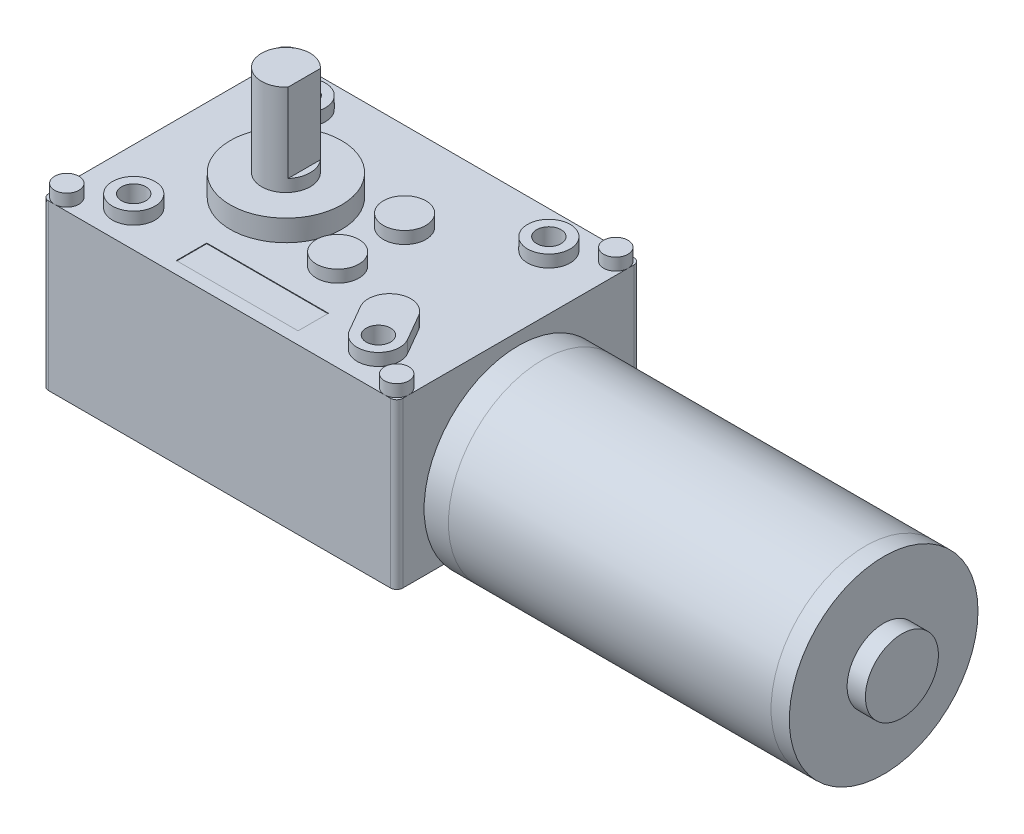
ISO-10303-21;
HEADER;
FILE_DESCRIPTION(('STEP AP214'),'2;1');
FILE_NAME('part.step','',(''),(''),'','','');
FILE_SCHEMA(('AUTOMOTIVE_DESIGN { 1 0 10303 214 1 1 1 1 }'));
ENDSEC;
DATA;
#1=APPLICATION_CONTEXT('core data for automotive mechanical design processes');
#2=APPLICATION_PROTOCOL_DEFINITION('international standard','automotive_design',2000,#1);
#3=PRODUCT_CONTEXT('',#1,'mechanical');
#4=PRODUCT('Part','Part','',(#3));
#5=PRODUCT_RELATED_PRODUCT_CATEGORY('part','',(#4));
#6=PRODUCT_DEFINITION_FORMATION('','',#4);
#7=PRODUCT_DEFINITION_CONTEXT('part definition',#1,'design');
#8=PRODUCT_DEFINITION('design','',#6,#7);
#9=PRODUCT_DEFINITION_SHAPE('','',#8);
#10=(LENGTH_UNIT() NAMED_UNIT(*) SI_UNIT(.MILLI.,.METRE.));
#11=(NAMED_UNIT(*) PLANE_ANGLE_UNIT() SI_UNIT($,.RADIAN.));
#12=(NAMED_UNIT(*) SI_UNIT($,.STERADIAN.) SOLID_ANGLE_UNIT());
#13=UNCERTAINTY_MEASURE_WITH_UNIT(LENGTH_MEASURE(1.E-05),#10,'distance_accuracy_value','');
#14=(GEOMETRIC_REPRESENTATION_CONTEXT(3) GLOBAL_UNCERTAINTY_ASSIGNED_CONTEXT((#13)) GLOBAL_UNIT_ASSIGNED_CONTEXT((#10,
#11,#12)) REPRESENTATION_CONTEXT('',''));
#15=CARTESIAN_POINT('',(0.,0.,0.));
#16=DIRECTION('',(0.,0.,1.));
#17=DIRECTION('',(1.,0.,0.));
#18=AXIS2_PLACEMENT_3D('',#15,#16,#17);
#19=CARTESIAN_POINT('',(118.2,-4.,-20.));
#20=DIRECTION('',(-1.,0.,0.));
#21=DIRECTION('',(0.,0.,1.));
#22=AXIS2_PLACEMENT_3D('',#19,#20,#21);
#23=CYLINDRICAL_SURFACE('',#22,15.5);
#24=CARTESIAN_POINT('',(118.2,-4.,-20.));
#25=DIRECTION('',(1.,0.,0.));
#26=DIRECTION('',(0.,0.,-1.));
#27=AXIS2_PLACEMENT_3D('',#24,#25,#26);
#28=CIRCLE('',#27,15.5);
#29=CARTESIAN_POINT('',(118.2,-4.,-35.5));
#30=VERTEX_POINT('',#29);
#31=EDGE_CURVE('E47',#30,#30,#28,.T.);
#32=ORIENTED_EDGE('',*,*,#31,.F.);
#33=EDGE_LOOP('',(#32));
#34=FACE_BOUND('',#33,.T.);
#35=CARTESIAN_POINT('',(115.2,-4.,-20.));
#36=DIRECTION('',(1.,0.,0.));
#37=DIRECTION('',(0.,0.,-1.));
#38=AXIS2_PLACEMENT_3D('',#35,#36,#37);
#39=CIRCLE('',#38,15.5);
#40=CARTESIAN_POINT('',(115.2,-4.,-35.5));
#41=VERTEX_POINT('',#40);
#42=EDGE_CURVE('E43',#41,#41,#39,.T.);
#43=ORIENTED_EDGE('',*,*,#42,.T.);
#44=EDGE_LOOP('',(#43));
#45=FACE_BOUND('',#44,.T.);
#46=ADVANCED_FACE('F40',(#34,#45),#23,.T.);
#47=CARTESIAN_POINT('',(118.2,-4.,-20.));
#48=DIRECTION('',(1.,0.,0.));
#49=DIRECTION('',(0.,0.,-1.));
#50=AXIS2_PLACEMENT_3D('',#47,#48,#49);
#51=PLANE('',#50);
#52=CARTESIAN_POINT('',(118.2,-4.,-20.));
#53=DIRECTION('',(1.,0.,0.));
#54=DIRECTION('',(0.,0.,-1.));
#55=AXIS2_PLACEMENT_3D('',#52,#53,#54);
#56=CIRCLE('',#55,6.);
#57=CARTESIAN_POINT('',(118.2,-4.,-26.));
#58=VERTEX_POINT('',#57);
#59=EDGE_CURVE('E11',#58,#58,#56,.T.);
#60=ORIENTED_EDGE('',*,*,#59,.F.);
#61=EDGE_LOOP('',(#60));
#62=FACE_BOUND('',#61,.T.);
#63=ORIENTED_EDGE('',*,*,#31,.T.);
#64=EDGE_LOOP('',(#63));
#65=FACE_BOUND('',#64,.T.);
#66=ADVANCED_FACE('F64',(#62,#65),#51,.T.);
#67=CARTESIAN_POINT('',(115.2,-4.,-20.));
#68=DIRECTION('',(1.,0.,0.));
#69=DIRECTION('',(0.,0.,-1.));
#70=AXIS2_PLACEMENT_3D('',#67,#68,#69);
#71=PLANE('',#70);
#72=ORIENTED_EDGE('',*,*,#42,.F.);
#73=EDGE_LOOP('',(#72));
#74=FACE_BOUND('',#73,.T.);
#75=ADVANCED_FACE('F61',(#74),#71,.F.);
#76=CARTESIAN_POINT('',(121.2,-4.,-20.));
#77=DIRECTION('',(-1.,0.,0.));
#78=DIRECTION('',(0.,0.,1.));
#79=AXIS2_PLACEMENT_3D('',#76,#77,#78);
#80=CYLINDRICAL_SURFACE('',#79,6.);
#81=CARTESIAN_POINT('',(121.2,-4.,-20.));
#82=DIRECTION('',(1.,0.,0.));
#83=DIRECTION('',(0.,0.,-1.));
#84=AXIS2_PLACEMENT_3D('',#81,#82,#83);
#85=CIRCLE('',#84,6.);
#86=CARTESIAN_POINT('',(121.2,-4.,-26.));
#87=VERTEX_POINT('',#86);
#88=EDGE_CURVE('E53',#87,#87,#85,.T.);
#89=ORIENTED_EDGE('',*,*,#88,.F.);
#90=EDGE_LOOP('',(#89));
#91=FACE_BOUND('',#90,.T.);
#92=ORIENTED_EDGE('',*,*,#59,.T.);
#93=EDGE_LOOP('',(#92));
#94=FACE_BOUND('',#93,.T.);
#95=ADVANCED_FACE('F63',(#91,#94),#80,.T.);
#96=CARTESIAN_POINT('',(121.2,-4.,-20.));
#97=DIRECTION('',(1.,0.,0.));
#98=DIRECTION('',(0.,0.,-1.));
#99=AXIS2_PLACEMENT_3D('',#96,#97,#98);
#100=PLANE('',#99);
#101=ORIENTED_EDGE('',*,*,#88,.T.);
#102=EDGE_LOOP('',(#101));
#103=FACE_BOUND('',#102,.T.);
#104=ADVANCED_FACE('F69',(#103),#100,.T.);
#105=CLOSED_SHELL('',(#46,#66,#75,#95,#104));
#106=MANIFOLD_SOLID_BREP('B2',#105);
#107=CARTESIAN_POINT('',(115.2,-4.,-20.));
#108=DIRECTION('',(-1.,0.,0.));
#109=DIRECTION('',(0.,0.,1.));
#110=AXIS2_PLACEMENT_3D('',#107,#108,#109);
#111=CYLINDRICAL_SURFACE('',#110,15.5);
#112=CARTESIAN_POINT('',(115.2,-4.,-20.));
#113=DIRECTION('',(1.,0.,0.));
#114=DIRECTION('',(0.,0.,-1.));
#115=AXIS2_PLACEMENT_3D('',#112,#113,#114);
#116=CIRCLE('',#115,15.5);
#117=CARTESIAN_POINT('',(115.2,-4.,-35.5));
#118=VERTEX_POINT('',#117);
#119=EDGE_CURVE('E39',#118,#118,#116,.T.);
#120=ORIENTED_EDGE('',*,*,#119,.F.);
#121=EDGE_LOOP('',(#120));
#122=FACE_BOUND('',#121,.T.);
#123=CARTESIAN_POINT('',(62.2,-4.,-20.));
#124=DIRECTION('',(1.,0.,0.));
#125=DIRECTION('',(0.,0.,-1.));
#126=AXIS2_PLACEMENT_3D('',#123,#124,#125);
#127=CIRCLE('',#126,15.5);
#128=CARTESIAN_POINT('',(62.2,-4.,-35.5));
#129=VERTEX_POINT('',#128);
#130=EDGE_CURVE('E122',#129,#129,#127,.T.);
#131=ORIENTED_EDGE('',*,*,#130,.T.);
#132=EDGE_LOOP('',(#131));
#133=FACE_BOUND('',#132,.T.);
#134=ADVANCED_FACE('F119',(#122,#133),#111,.T.);
#135=CARTESIAN_POINT('',(115.2,-4.,-20.));
#136=DIRECTION('',(1.,0.,0.));
#137=DIRECTION('',(0.,0.,-1.));
#138=AXIS2_PLACEMENT_3D('',#135,#136,#137);
#139=PLANE('',#138);
#140=ORIENTED_EDGE('',*,*,#119,.T.);
#141=EDGE_LOOP('',(#140));
#142=FACE_BOUND('',#141,.T.);
#143=ADVANCED_FACE('F134',(#142),#139,.T.);
#144=CARTESIAN_POINT('',(62.2,-4.,-20.));
#145=DIRECTION('',(1.,0.,0.));
#146=DIRECTION('',(0.,0.,-1.));
#147=AXIS2_PLACEMENT_3D('',#144,#145,#146);
#148=PLANE('',#147);
#149=ORIENTED_EDGE('',*,*,#130,.F.);
#150=EDGE_LOOP('',(#149));
#151=FACE_BOUND('',#150,.T.);
#152=ADVANCED_FACE('F132',(#151),#148,.F.);
#153=CLOSED_SHELL('',(#134,#143,#152));
#154=MANIFOLD_SOLID_BREP('B6',#153);
#155=CARTESIAN_POINT('',(62.2,-4.,-20.));
#156=DIRECTION('',(-1.,0.,0.));
#157=DIRECTION('',(0.,0.,1.));
#158=AXIS2_PLACEMENT_3D('',#155,#156,#157);
#159=CYLINDRICAL_SURFACE('',#158,15.5);
#160=CARTESIAN_POINT('',(62.2,-4.,-20.));
#161=DIRECTION('',(1.,0.,0.));
#162=DIRECTION('',(0.,0.,-1.));
#163=AXIS2_PLACEMENT_3D('',#160,#161,#162);
#164=CIRCLE('',#163,15.5);
#165=CARTESIAN_POINT('',(62.2,-4.,-35.5));
#166=VERTEX_POINT('',#165);
#167=EDGE_CURVE('E118',#166,#166,#164,.T.);
#168=ORIENTED_EDGE('',*,*,#167,.F.);
#169=EDGE_LOOP('',(#168));
#170=FACE_BOUND('',#169,.T.);
#171=CARTESIAN_POINT('',(58.2,-4.,-20.));
#172=DIRECTION('',(1.,0.,0.));
#173=DIRECTION('',(0.,0.,-1.));
#174=AXIS2_PLACEMENT_3D('',#171,#172,#173);
#175=CIRCLE('',#174,15.5);
#176=CARTESIAN_POINT('',(58.2,-4.,-35.5));
#177=VERTEX_POINT('',#176);
#178=EDGE_CURVE('E172',#177,#177,#175,.T.);
#179=ORIENTED_EDGE('',*,*,#178,.T.);
#180=EDGE_LOOP('',(#179));
#181=FACE_BOUND('',#180,.T.);
#182=ADVANCED_FACE('F169',(#170,#181),#159,.T.);
#183=CARTESIAN_POINT('',(62.2,-4.,-20.));
#184=DIRECTION('',(1.,0.,0.));
#185=DIRECTION('',(0.,0.,-1.));
#186=AXIS2_PLACEMENT_3D('',#183,#184,#185);
#187=PLANE('',#186);
#188=ORIENTED_EDGE('',*,*,#167,.T.);
#189=EDGE_LOOP('',(#188));
#190=FACE_BOUND('',#189,.T.);
#191=ADVANCED_FACE('F184',(#190),#187,.T.);
#192=CARTESIAN_POINT('',(58.2,-4.,-20.));
#193=DIRECTION('',(1.,0.,0.));
#194=DIRECTION('',(0.,0.,-1.));
#195=AXIS2_PLACEMENT_3D('',#192,#193,#194);
#196=PLANE('',#195);
#197=ORIENTED_EDGE('',*,*,#178,.F.);
#198=EDGE_LOOP('',(#197));
#199=FACE_BOUND('',#198,.T.);
#200=ADVANCED_FACE('F182',(#199),#196,.F.);
#201=CLOSED_SHELL('',(#182,#191,#200));
#202=MANIFOLD_SOLID_BREP('B34',#201);
#203=CARTESIAN_POINT('',(0.,13.5,0.));
#204=DIRECTION('',(0.,-1.,0.));
#205=DIRECTION('',(0.,0.,-1.));
#206=AXIS2_PLACEMENT_3D('',#203,#204,#205);
#207=PLANE('',#206);
#208=DIRECTION('',(1.,0.,0.));
#209=VECTOR('',#208,1.);
#210=CARTESIAN_POINT('',(20.,13.5,-2.));
#211=LINE('',#210,#209);
#212=CARTESIAN_POINT('',(20.,13.5,-2.));
#213=VERTEX_POINT('',#212);
#214=CARTESIAN_POINT('',(40.,13.5,-2.));
#215=VERTEX_POINT('',#214);
#216=EDGE_CURVE('E459',#213,#215,#211,.T.);
#217=ORIENTED_EDGE('',*,*,#216,.F.);
#218=DIRECTION('',(0.,0.,1.));
#219=VECTOR('',#218,1.);
#220=CARTESIAN_POINT('',(20.,13.5,-7.));
#221=LINE('',#220,#219);
#222=CARTESIAN_POINT('',(20.,13.5,-7.));
#223=VERTEX_POINT('',#222);
#224=EDGE_CURVE('E233',#223,#213,#221,.T.);
#225=ORIENTED_EDGE('',*,*,#224,.F.);
#226=DIRECTION('',(-1.,0.,0.));
#227=VECTOR('',#226,1.);
#228=CARTESIAN_POINT('',(20.,13.5,-7.));
#229=LINE('',#228,#227);
#230=CARTESIAN_POINT('',(40.,13.5,-7.));
#231=VERTEX_POINT('',#230);
#232=EDGE_CURVE('E448',#231,#223,#229,.T.);
#233=ORIENTED_EDGE('',*,*,#232,.F.);
#234=DIRECTION('',(0.,0.,-1.));
#235=VECTOR('',#234,1.);
#236=CARTESIAN_POINT('',(40.,13.5,-7.));
#237=LINE('',#236,#235);
#238=EDGE_CURVE('E462',#215,#231,#237,.T.);
#239=ORIENTED_EDGE('',*,*,#238,.F.);
#240=EDGE_LOOP('',(#217,#225,#233,#239));
#241=FACE_BOUND('',#240,.T.);
#242=CARTESIAN_POINT('',(20.,13.5,-20.));
#243=DIRECTION('',(0.,-1.,0.));
#244=DIRECTION('',(0.,0.,-1.));
#245=AXIS2_PLACEMENT_3D('',#242,#243,#244);
#246=CIRCLE('',#245,9.15);
#247=CARTESIAN_POINT('',(20.,13.5,-29.15));
#248=VERTEX_POINT('',#247);
#249=EDGE_CURVE('E543',#248,#248,#246,.F.);
#250=ORIENTED_EDGE('',*,*,#249,.F.);
#251=EDGE_LOOP('',(#250));
#252=FACE_BOUND('',#251,.T.);
#253=CARTESIAN_POINT('',(34.,13.5,-25.5));
#254=DIRECTION('',(0.,-1.,0.));
#255=DIRECTION('',(0.,0.,-1.));
#256=AXIS2_PLACEMENT_3D('',#253,#254,#255);
#257=CIRCLE('',#256,3.49999999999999);
#258=CARTESIAN_POINT('',(34.,13.5,-29.));
#259=VERTEX_POINT('',#258);
#260=EDGE_CURVE('E552',#259,#259,#257,.F.);
#261=ORIENTED_EDGE('',*,*,#260,.F.);
#262=EDGE_LOOP('',(#261));
#263=FACE_BOUND('',#262,.T.);
#264=CARTESIAN_POINT('',(34.,13.5,-14.5));
#265=DIRECTION('',(0.,-1.,0.));
#266=DIRECTION('',(0.,0.,-1.));
#267=AXIS2_PLACEMENT_3D('',#264,#265,#266);
#268=CIRCLE('',#267,3.5);
#269=CARTESIAN_POINT('',(34.,13.5,-18.));
#270=VERTEX_POINT('',#269);
#271=EDGE_CURVE('E562',#270,#270,#268,.F.);
#272=ORIENTED_EDGE('',*,*,#271,.F.);
#273=EDGE_LOOP('',(#272));
#274=FACE_BOUND('',#273,.T.);
#275=CARTESIAN_POINT('',(9.00000000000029,13.5,-6.));
#276=DIRECTION('',(0.,-1.,0.));
#277=DIRECTION('',(0.,0.,-1.));
#278=AXIS2_PLACEMENT_3D('',#275,#276,#277);
#279=CIRCLE('',#278,3.5);
#280=CARTESIAN_POINT('',(9.00000000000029,13.5,-9.50000000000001));
#281=VERTEX_POINT('',#280);
#282=EDGE_CURVE('E572',#281,#281,#279,.F.);
#283=ORIENTED_EDGE('',*,*,#282,.F.);
#284=EDGE_LOOP('',(#283));
#285=FACE_BOUND('',#284,.T.);
#286=CARTESIAN_POINT('',(49.2,13.5,-34.));
#287=DIRECTION('',(0.,-1.,0.));
#288=DIRECTION('',(0.,0.,-1.));
#289=AXIS2_PLACEMENT_3D('',#286,#287,#288);
#290=CIRCLE('',#289,3.5);
#291=CARTESIAN_POINT('',(49.2,13.5,-37.5));
#292=VERTEX_POINT('',#291);
#293=EDGE_CURVE('E582',#292,#292,#290,.F.);
#294=ORIENTED_EDGE('',*,*,#293,.F.);
#295=EDGE_LOOP('',(#294));
#296=FACE_BOUND('',#295,.T.);
#297=CARTESIAN_POINT('',(2.00000000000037,13.5,-2.));
#298=DIRECTION('',(0.,1.,0.));
#299=DIRECTION('',(0.,0.,1.));
#300=AXIS2_PLACEMENT_3D('',#297,#298,#299);
#301=CIRCLE('',#300,2.);
#302=CARTESIAN_POINT('',(2.00000000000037,13.5,0.));
#303=VERTEX_POINT('',#302);
#304=CARTESIAN_POINT('',(0.,13.5,-2.));
#305=VERTEX_POINT('',#304);
#306=EDGE_CURVE('E658',#303,#305,#301,.T.);
#307=ORIENTED_EDGE('',*,*,#306,.F.);
#308=DIRECTION('',(1.,0.,0.));
#309=VECTOR('',#308,1.);
#310=CARTESIAN_POINT('',(0.,13.5,0.));
#311=LINE('',#310,#309);
#312=CARTESIAN_POINT('',(56.2,13.5,0.));
#313=VERTEX_POINT('',#312);
#314=EDGE_CURVE('E690',#303,#313,#311,.T.);
#315=ORIENTED_EDGE('',*,*,#314,.T.);
#316=CARTESIAN_POINT('',(56.2,13.5,-2.));
#317=DIRECTION('',(0.,1.,0.));
#318=DIRECTION('',(0.,0.,1.));
#319=AXIS2_PLACEMENT_3D('',#316,#317,#318);
#320=CIRCLE('',#319,2.);
#321=CARTESIAN_POINT('',(58.2,13.5,-2.));
#322=VERTEX_POINT('',#321);
#323=EDGE_CURVE('E657',#322,#313,#320,.T.);
#324=ORIENTED_EDGE('',*,*,#323,.F.);
#325=DIRECTION('',(0.,0.,-1.));
#326=VECTOR('',#325,1.);
#327=CARTESIAN_POINT('',(58.2,13.5,0.));
#328=LINE('',#327,#326);
#329=CARTESIAN_POINT('',(58.2,13.5,-38.));
#330=VERTEX_POINT('',#329);
#331=EDGE_CURVE('E694',#322,#330,#328,.T.);
#332=ORIENTED_EDGE('',*,*,#331,.T.);
#333=CARTESIAN_POINT('',(56.2,13.5,-38.));
#334=DIRECTION('',(0.,-1.,0.));
#335=DIRECTION('',(0.,0.,-1.));
#336=AXIS2_PLACEMENT_3D('',#333,#334,#335);
#337=CIRCLE('',#336,2.);
#338=CARTESIAN_POINT('',(56.2,13.5,-40.));
#339=VERTEX_POINT('',#338);
#340=EDGE_CURVE('E653',#339,#330,#337,.F.);
#341=ORIENTED_EDGE('',*,*,#340,.F.);
#342=DIRECTION('',(-1.,0.,0.));
#343=VECTOR('',#342,1.);
#344=CARTESIAN_POINT('',(0.,13.5,-40.));
#345=LINE('',#344,#343);
#346=CARTESIAN_POINT('',(2.,13.5,-40.));
#347=VERTEX_POINT('',#346);
#348=EDGE_CURVE('E697',#339,#347,#345,.T.);
#349=ORIENTED_EDGE('',*,*,#348,.T.);
#350=CARTESIAN_POINT('',(2.,13.5,-38.));
#351=DIRECTION('',(0.,1.,0.));
#352=DIRECTION('',(0.,0.,1.));
#353=AXIS2_PLACEMENT_3D('',#350,#351,#352);
#354=CIRCLE('',#353,2.);
#355=CARTESIAN_POINT('',(0.,13.5,-38.));
#356=VERTEX_POINT('',#355);
#357=EDGE_CURVE('E681',#356,#347,#354,.T.);
#358=ORIENTED_EDGE('',*,*,#357,.F.);
#359=DIRECTION('',(0.,0.,1.));
#360=VECTOR('',#359,1.);
#361=CARTESIAN_POINT('',(0.,13.5,0.));
#362=LINE('',#361,#360);
#363=EDGE_CURVE('E685',#356,#305,#362,.T.);
#364=ORIENTED_EDGE('',*,*,#363,.T.);
#365=EDGE_LOOP('',(#307,#315,#324,#332,#341,#349,#358,#364));
#366=FACE_BOUND('',#365,.T.);
#367=CARTESIAN_POINT('',(9.,13.5,-34.));
#368=DIRECTION('',(0.,-1.,0.));
#369=DIRECTION('',(0.,0.,-1.));
#370=AXIS2_PLACEMENT_3D('',#367,#368,#369);
#371=CIRCLE('',#370,3.5);
#372=CARTESIAN_POINT('',(9.,13.5,-37.5));
#373=VERTEX_POINT('',#372);
#374=EDGE_CURVE('E649',#373,#373,#371,.F.);
#375=ORIENTED_EDGE('',*,*,#374,.F.);
#376=EDGE_LOOP('',(#375));
#377=FACE_BOUND('',#376,.T.);
#378=CARTESIAN_POINT('',(46.7,13.5,-10.3301270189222));
#379=DIRECTION('',(0.,-1.,0.));
#380=DIRECTION('',(0.,0.,-1.));
#381=AXIS2_PLACEMENT_3D('',#378,#379,#380);
#382=CIRCLE('',#381,3.5);
#383=CARTESIAN_POINT('',(49.7310889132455,13.5,-12.0801270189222));
#384=VERTEX_POINT('',#383);
#385=CARTESIAN_POINT('',(43.6689110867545,13.5,-8.5801270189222));
#386=VERTEX_POINT('',#385);
#387=EDGE_CURVE('E639',#384,#386,#382,.F.);
#388=ORIENTED_EDGE('',*,*,#387,.F.);
#389=DIRECTION('',(-0.500000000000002,0.,-0.866025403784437));
#390=VECTOR('',#389,1.);
#391=CARTESIAN_POINT('',(42.5291651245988,13.5,-24.5542249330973));
#392=LINE('',#391,#390);
#393=CARTESIAN_POINT('',(52.2310889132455,13.5,-7.75000000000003));
#394=VERTEX_POINT('',#393);
#395=EDGE_CURVE('E630',#394,#384,#392,.T.);
#396=ORIENTED_EDGE('',*,*,#395,.F.);
#397=CARTESIAN_POINT('',(49.2,13.5,-6.));
#398=DIRECTION('',(0.,-1.,0.));
#399=DIRECTION('',(0.,0.,-1.));
#400=AXIS2_PLACEMENT_3D('',#397,#398,#399);
#401=CIRCLE('',#400,3.50000000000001);
#402=CARTESIAN_POINT('',(46.1689110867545,13.5,-4.24999999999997));
#403=VERTEX_POINT('',#402);
#404=EDGE_CURVE('E633',#403,#394,#401,.F.);
#405=ORIENTED_EDGE('',*,*,#404,.F.);
#406=DIRECTION('',(0.5,0.,0.866025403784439));
#407=VECTOR('',#406,1.);
#408=CARTESIAN_POINT('',(36.4669872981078,13.5,-21.0542249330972));
#409=LINE('',#408,#407);
#410=EDGE_CURVE('E636',#386,#403,#409,.T.);
#411=ORIENTED_EDGE('',*,*,#410,.F.);
#412=EDGE_LOOP('',(#388,#396,#405,#411));
#413=FACE_BOUND('',#412,.T.);
#414=ADVANCED_FACE('F210',(#241,#252,#263,#274,#285,#296,#366,#377,#413),#207,.F.);
#415=CARTESIAN_POINT('',(0.,-13.5,0.));
#416=DIRECTION('',(0.,-1.,0.));
#417=DIRECTION('',(0.,0.,-1.));
#418=AXIS2_PLACEMENT_3D('',#415,#416,#417);
#419=PLANE('',#418);
#420=DIRECTION('',(0.,0.,-1.));
#421=VECTOR('',#420,1.);
#422=CARTESIAN_POINT('',(20.,-13.5,-2.));
#423=LINE('',#422,#421);
#424=CARTESIAN_POINT('',(20.,-13.5,-2.));
#425=VERTEX_POINT('',#424);
#426=CARTESIAN_POINT('',(20.,-13.5,-7.));
#427=VERTEX_POINT('',#426);
#428=EDGE_CURVE('E225',#425,#427,#423,.T.);
#429=ORIENTED_EDGE('',*,*,#428,.F.);
#430=DIRECTION('',(-1.,0.,0.));
#431=VECTOR('',#430,1.);
#432=CARTESIAN_POINT('',(20.,-13.5,-2.));
#433=LINE('',#432,#431);
#434=CARTESIAN_POINT('',(40.,-13.5,-2.));
#435=VERTEX_POINT('',#434);
#436=EDGE_CURVE('E426',#435,#425,#433,.T.);
#437=ORIENTED_EDGE('',*,*,#436,.F.);
#438=DIRECTION('',(0.,0.,1.));
#439=VECTOR('',#438,1.);
#440=CARTESIAN_POINT('',(40.,-13.5,-2.));
#441=LINE('',#440,#439);
#442=CARTESIAN_POINT('',(40.,-13.5,-7.));
#443=VERTEX_POINT('',#442);
#444=EDGE_CURVE('E429',#443,#435,#441,.T.);
#445=ORIENTED_EDGE('',*,*,#444,.F.);
#446=DIRECTION('',(1.,0.,0.));
#447=VECTOR('',#446,1.);
#448=CARTESIAN_POINT('',(20.,-13.5,-7.));
#449=LINE('',#448,#447);
#450=EDGE_CURVE('E435',#427,#443,#449,.T.);
#451=ORIENTED_EDGE('',*,*,#450,.F.);
#452=EDGE_LOOP('',(#429,#437,#445,#451));
#453=FACE_BOUND('',#452,.T.);
#454=CARTESIAN_POINT('',(20.,-13.5,-20.));
#455=DIRECTION('',(0.,-1.,0.));
#456=DIRECTION('',(0.,0.,-1.));
#457=AXIS2_PLACEMENT_3D('',#454,#455,#456);
#458=CIRCLE('',#457,9.15);
#459=CARTESIAN_POINT('',(20.,-13.5,-29.15));
#460=VERTEX_POINT('',#459);
#461=EDGE_CURVE('E547',#460,#460,#458,.F.);
#462=ORIENTED_EDGE('',*,*,#461,.T.);
#463=EDGE_LOOP('',(#462));
#464=FACE_BOUND('',#463,.T.);
#465=CARTESIAN_POINT('',(34.,-13.5,-25.5));
#466=DIRECTION('',(0.,-1.,0.));
#467=DIRECTION('',(0.,0.,-1.));
#468=AXIS2_PLACEMENT_3D('',#465,#466,#467);
#469=CIRCLE('',#468,3.49999999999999);
#470=CARTESIAN_POINT('',(34.,-13.5,-29.));
#471=VERTEX_POINT('',#470);
#472=EDGE_CURVE('E556',#471,#471,#469,.F.);
#473=ORIENTED_EDGE('',*,*,#472,.T.);
#474=EDGE_LOOP('',(#473));
#475=FACE_BOUND('',#474,.T.);
#476=CARTESIAN_POINT('',(34.,-13.5,-14.5));
#477=DIRECTION('',(0.,-1.,0.));
#478=DIRECTION('',(0.,0.,-1.));
#479=AXIS2_PLACEMENT_3D('',#476,#477,#478);
#480=CIRCLE('',#479,3.5);
#481=CARTESIAN_POINT('',(34.,-13.5,-18.));
#482=VERTEX_POINT('',#481);
#483=EDGE_CURVE('E566',#482,#482,#480,.F.);
#484=ORIENTED_EDGE('',*,*,#483,.T.);
#485=EDGE_LOOP('',(#484));
#486=FACE_BOUND('',#485,.T.);
#487=CARTESIAN_POINT('',(9.00000000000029,-13.5,-6.));
#488=DIRECTION('',(0.,-1.,0.));
#489=DIRECTION('',(0.,0.,-1.));
#490=AXIS2_PLACEMENT_3D('',#487,#488,#489);
#491=CIRCLE('',#490,3.5);
#492=CARTESIAN_POINT('',(9.00000000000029,-13.5,-9.50000000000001));
#493=VERTEX_POINT('',#492);
#494=EDGE_CURVE('E576',#493,#493,#491,.F.);
#495=ORIENTED_EDGE('',*,*,#494,.T.);
#496=EDGE_LOOP('',(#495));
#497=FACE_BOUND('',#496,.T.);
#498=CARTESIAN_POINT('',(49.2,-13.5,-34.));
#499=DIRECTION('',(0.,-1.,0.));
#500=DIRECTION('',(0.,0.,-1.));
#501=AXIS2_PLACEMENT_3D('',#498,#499,#500);
#502=CIRCLE('',#501,3.5);
#503=CARTESIAN_POINT('',(49.2,-13.5,-37.5));
#504=VERTEX_POINT('',#503);
#505=EDGE_CURVE('E586',#504,#504,#502,.F.);
#506=ORIENTED_EDGE('',*,*,#505,.T.);
#507=EDGE_LOOP('',(#506));
#508=FACE_BOUND('',#507,.T.);
#509=CARTESIAN_POINT('',(9.,-13.5,-34.));
#510=DIRECTION('',(0.,-1.,0.));
#511=DIRECTION('',(0.,0.,-1.));
#512=AXIS2_PLACEMENT_3D('',#509,#510,#511);
#513=CIRCLE('',#512,3.5);
#514=CARTESIAN_POINT('',(9.,-13.5,-37.5));
#515=VERTEX_POINT('',#514);
#516=EDGE_CURVE('E646',#515,#515,#513,.F.);
#517=ORIENTED_EDGE('',*,*,#516,.T.);
#518=EDGE_LOOP('',(#517));
#519=FACE_BOUND('',#518,.T.);
#520=DIRECTION('',(0.,0.,1.));
#521=VECTOR('',#520,1.);
#522=CARTESIAN_POINT('',(0.,-13.5,0.));
#523=LINE('',#522,#521);
#524=CARTESIAN_POINT('',(0.,-13.5,-39.));
#525=VERTEX_POINT('',#524);
#526=CARTESIAN_POINT('',(0.,-13.5,-1.));
#527=VERTEX_POINT('',#526);
#528=EDGE_CURVE('E678',#525,#527,#523,.T.);
#529=ORIENTED_EDGE('',*,*,#528,.F.);
#530=CARTESIAN_POINT('',(1.,-13.5,-39.));
#531=DIRECTION('',(0.,-1.,0.));
#532=DIRECTION('',(0.,0.,-1.));
#533=AXIS2_PLACEMENT_3D('',#530,#531,#532);
#534=CIRCLE('',#533,1.);
#535=CARTESIAN_POINT('',(1.,-13.5,-40.));
#536=VERTEX_POINT('',#535);
#537=EDGE_CURVE('E743',#525,#536,#534,.T.);
#538=ORIENTED_EDGE('',*,*,#537,.T.);
#539=DIRECTION('',(-1.,0.,0.));
#540=VECTOR('',#539,1.);
#541=CARTESIAN_POINT('',(0.,-13.5,-40.));
#542=LINE('',#541,#540);
#543=CARTESIAN_POINT('',(57.2,-13.5,-40.));
#544=VERTEX_POINT('',#543);
#545=EDGE_CURVE('E706',#544,#536,#542,.T.);
#546=ORIENTED_EDGE('',*,*,#545,.F.);
#547=CARTESIAN_POINT('',(57.2,-13.5,-39.));
#548=DIRECTION('',(0.,-1.,0.));
#549=DIRECTION('',(0.,0.,-1.));
#550=AXIS2_PLACEMENT_3D('',#547,#548,#549);
#551=CIRCLE('',#550,1.);
#552=CARTESIAN_POINT('',(58.2,-13.5,-39.));
#553=VERTEX_POINT('',#552);
#554=EDGE_CURVE('E741',#544,#553,#551,.T.);
#555=ORIENTED_EDGE('',*,*,#554,.T.);
#556=DIRECTION('',(0.,0.,-1.));
#557=VECTOR('',#556,1.);
#558=CARTESIAN_POINT('',(58.2,-13.5,0.));
#559=LINE('',#558,#557);
#560=CARTESIAN_POINT('',(58.2,-13.5,-1.));
#561=VERTEX_POINT('',#560);
#562=EDGE_CURVE('E703',#561,#553,#559,.T.);
#563=ORIENTED_EDGE('',*,*,#562,.F.);
#564=CARTESIAN_POINT('',(57.2,-13.5,-1.));
#565=DIRECTION('',(0.,-1.,0.));
#566=DIRECTION('',(0.,0.,-1.));
#567=AXIS2_PLACEMENT_3D('',#564,#565,#566);
#568=CIRCLE('',#567,1.);
#569=CARTESIAN_POINT('',(57.2,-13.5,0.));
#570=VERTEX_POINT('',#569);
#571=EDGE_CURVE('E739',#561,#570,#568,.T.);
#572=ORIENTED_EDGE('',*,*,#571,.T.);
#573=DIRECTION('',(1.,0.,0.));
#574=VECTOR('',#573,1.);
#575=CARTESIAN_POINT('',(0.,-13.5,0.));
#576=LINE('',#575,#574);
#577=CARTESIAN_POINT('',(1.,-13.5,0.));
#578=VERTEX_POINT('',#577);
#579=EDGE_CURVE('E700',#578,#570,#576,.T.);
#580=ORIENTED_EDGE('',*,*,#579,.F.);
#581=CARTESIAN_POINT('',(1.,-13.5,-1.));
#582=DIRECTION('',(0.,-1.,0.));
#583=DIRECTION('',(0.,0.,-1.));
#584=AXIS2_PLACEMENT_3D('',#581,#582,#583);
#585=CIRCLE('',#584,1.);
#586=EDGE_CURVE('E737',#578,#527,#585,.T.);
#587=ORIENTED_EDGE('',*,*,#586,.T.);
#588=EDGE_LOOP('',(#529,#538,#546,#555,#563,#572,#580,#587));
#589=FACE_BOUND('',#588,.T.);
#590=DIRECTION('',(-0.500000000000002,0.,-0.866025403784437));
#591=VECTOR('',#590,1.);
#592=CARTESIAN_POINT('',(42.5291651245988,-13.5,-24.5542249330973));
#593=LINE('',#592,#591);
#594=CARTESIAN_POINT('',(52.2310889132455,-13.5,-7.75000000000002));
#595=VERTEX_POINT('',#594);
#596=CARTESIAN_POINT('',(49.7310889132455,-13.5,-12.0801270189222));
#597=VERTEX_POINT('',#596);
#598=EDGE_CURVE('E652',#595,#597,#593,.T.);
#599=ORIENTED_EDGE('',*,*,#598,.T.);
#600=CARTESIAN_POINT('',(46.7,-13.5,-10.3301270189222));
#601=DIRECTION('',(0.,-1.,0.));
#602=DIRECTION('',(0.,0.,-1.));
#603=AXIS2_PLACEMENT_3D('',#600,#601,#602);
#604=CIRCLE('',#603,3.5);
#605=CARTESIAN_POINT('',(43.6689110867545,-13.5,-8.5801270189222));
#606=VERTEX_POINT('',#605);
#607=EDGE_CURVE('E592',#597,#606,#604,.F.);
#608=ORIENTED_EDGE('',*,*,#607,.T.);
#609=DIRECTION('',(0.5,0.,0.866025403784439));
#610=VECTOR('',#609,1.);
#611=CARTESIAN_POINT('',(36.4669872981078,-13.5,-21.0542249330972));
#612=LINE('',#611,#610);
#613=CARTESIAN_POINT('',(46.1689110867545,-13.5,-4.24999999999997));
#614=VERTEX_POINT('',#613);
#615=EDGE_CURVE('E718',#606,#614,#612,.T.);
#616=ORIENTED_EDGE('',*,*,#615,.T.);
#617=CARTESIAN_POINT('',(49.2,-13.5,-6.));
#618=DIRECTION('',(0.,-1.,0.));
#619=DIRECTION('',(0.,0.,-1.));
#620=AXIS2_PLACEMENT_3D('',#617,#618,#619);
#621=CIRCLE('',#620,3.50000000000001);
#622=EDGE_CURVE('E715',#614,#595,#621,.F.);
#623=ORIENTED_EDGE('',*,*,#622,.T.);
#624=EDGE_LOOP('',(#599,#608,#616,#623));
#625=FACE_BOUND('',#624,.T.);
#626=ADVANCED_FACE('F783',(#453,#464,#475,#486,#497,#508,#519,#589,#625),#419,.T.);
#627=CARTESIAN_POINT('',(0.,13.5,-1.));
#628=VERTEX_POINT('',#627);
#629=EDGE_CURVE('E686',#305,#628,#362,.T.);
#630=ORIENTED_EDGE('',*,*,#629,.T.);
#631=CARTESIAN_POINT('',(1.,13.5,-1.));
#632=DIRECTION('',(0.,-1.,0.));
#633=DIRECTION('',(0.,0.,-1.));
#634=AXIS2_PLACEMENT_3D('',#631,#632,#633);
#635=CIRCLE('',#634,1.);
#636=CARTESIAN_POINT('',(1.,13.5,0.));
#637=VERTEX_POINT('',#636);
#638=EDGE_CURVE('E167',#628,#637,#635,.F.);
#639=ORIENTED_EDGE('',*,*,#638,.T.);
#640=EDGE_CURVE('E687',#637,#303,#311,.T.);
#641=ORIENTED_EDGE('',*,*,#640,.T.);
#642=EDGE_CURVE('E661',#305,#303,#301,.T.);
#643=ORIENTED_EDGE('',*,*,#642,.F.);
#644=EDGE_LOOP('',(#630,#639,#641,#643));
#645=FACE_BOUND('',#644,.T.);
#646=ADVANCED_FACE('F846',(#645),#207,.F.);
#647=CARTESIAN_POINT('',(57.2,13.5,0.));
#648=VERTEX_POINT('',#647);
#649=EDGE_CURVE('E684',#313,#648,#311,.T.);
#650=ORIENTED_EDGE('',*,*,#649,.T.);
#651=CARTESIAN_POINT('',(57.2,13.5,-1.));
#652=DIRECTION('',(0.,-1.,0.));
#653=DIRECTION('',(0.,0.,-1.));
#654=AXIS2_PLACEMENT_3D('',#651,#652,#653);
#655=CIRCLE('',#654,1.);
#656=CARTESIAN_POINT('',(58.2,13.5,-1.));
#657=VERTEX_POINT('',#656);
#658=EDGE_CURVE('E218',#648,#657,#655,.F.);
#659=ORIENTED_EDGE('',*,*,#658,.T.);
#660=EDGE_CURVE('E691',#657,#322,#328,.T.);
#661=ORIENTED_EDGE('',*,*,#660,.T.);
#662=EDGE_CURVE('E666',#313,#322,#320,.T.);
#663=ORIENTED_EDGE('',*,*,#662,.F.);
#664=EDGE_LOOP('',(#650,#659,#661,#663));
#665=FACE_BOUND('',#664,.T.);
#666=ADVANCED_FACE('F767',(#665),#207,.F.);
#667=CARTESIAN_POINT('',(1.,13.5,-40.));
#668=VERTEX_POINT('',#667);
#669=EDGE_CURVE('E693',#347,#668,#345,.T.);
#670=ORIENTED_EDGE('',*,*,#669,.T.);
#671=CARTESIAN_POINT('',(1.,13.5,-39.));
#672=DIRECTION('',(0.,-1.,0.));
#673=DIRECTION('',(0.,0.,-1.));
#674=AXIS2_PLACEMENT_3D('',#671,#672,#673);
#675=CIRCLE('',#674,1.);
#676=CARTESIAN_POINT('',(0.,13.5,-39.));
#677=VERTEX_POINT('',#676);
#678=EDGE_CURVE('E750',#668,#677,#675,.F.);
#679=ORIENTED_EDGE('',*,*,#678,.T.);
#680=EDGE_CURVE('E682',#677,#356,#362,.T.);
#681=ORIENTED_EDGE('',*,*,#680,.T.);
#682=EDGE_CURVE('E672',#347,#356,#354,.T.);
#683=ORIENTED_EDGE('',*,*,#682,.F.);
#684=EDGE_LOOP('',(#670,#679,#681,#683));
#685=FACE_BOUND('',#684,.T.);
#686=ADVANCED_FACE('F859',(#685),#207,.F.);
#687=CARTESIAN_POINT('',(0.,13.5,0.));
#688=DIRECTION('',(1.,0.,0.));
#689=DIRECTION('',(0.,0.,-1.));
#690=AXIS2_PLACEMENT_3D('',#687,#688,#689);
#691=PLANE('',#690);
#692=ORIENTED_EDGE('',*,*,#680,.F.);
#693=DIRECTION('',(0.,-1.,0.));
#694=VECTOR('',#693,1.);
#695=CARTESIAN_POINT('',(0.,13.5,-39.));
#696=LINE('',#695,#694);
#697=EDGE_CURVE('E734',#677,#525,#696,.T.);
#698=ORIENTED_EDGE('',*,*,#697,.T.);
#699=ORIENTED_EDGE('',*,*,#528,.T.);
#700=DIRECTION('',(0.,-1.,0.));
#701=VECTOR('',#700,1.);
#702=CARTESIAN_POINT('',(0.,13.5,-1.));
#703=LINE('',#702,#701);
#704=EDGE_CURVE('E542',#527,#628,#703,.F.);
#705=ORIENTED_EDGE('',*,*,#704,.T.);
#706=ORIENTED_EDGE('',*,*,#629,.F.);
#707=ORIENTED_EDGE('',*,*,#363,.F.);
#708=EDGE_LOOP('',(#692,#698,#699,#705,#706,#707));
#709=FACE_BOUND('',#708,.T.);
#710=ADVANCED_FACE('F795',(#709),#691,.F.);
#711=CARTESIAN_POINT('',(0.,13.5,0.));
#712=DIRECTION('',(0.,0.,-1.));
#713=DIRECTION('',(-1.,0.,0.));
#714=AXIS2_PLACEMENT_3D('',#711,#712,#713);
#715=PLANE('',#714);
#716=ORIENTED_EDGE('',*,*,#579,.T.);
#717=DIRECTION('',(0.,-1.,0.));
#718=VECTOR('',#717,1.);
#719=CARTESIAN_POINT('',(57.2,13.5,0.));
#720=LINE('',#719,#718);
#721=EDGE_CURVE('E762',#570,#648,#720,.F.);
#722=ORIENTED_EDGE('',*,*,#721,.T.);
#723=ORIENTED_EDGE('',*,*,#649,.F.);
#724=ORIENTED_EDGE('',*,*,#314,.F.);
#725=ORIENTED_EDGE('',*,*,#640,.F.);
#726=DIRECTION('',(0.,-1.,0.));
#727=VECTOR('',#726,1.);
#728=CARTESIAN_POINT('',(1.,13.5,0.));
#729=LINE('',#728,#727);
#730=EDGE_CURVE('E759',#637,#578,#729,.T.);
#731=ORIENTED_EDGE('',*,*,#730,.T.);
#732=EDGE_LOOP('',(#716,#722,#723,#724,#725,#731));
#733=FACE_BOUND('',#732,.T.);
#734=ADVANCED_FACE('F786',(#733),#715,.F.);
#735=CARTESIAN_POINT('',(58.2,13.5,0.));
#736=DIRECTION('',(-1.,0.,0.));
#737=DIRECTION('',(0.,0.,1.));
#738=AXIS2_PLACEMENT_3D('',#735,#736,#737);
#739=PLANE('',#738);
#740=ORIENTED_EDGE('',*,*,#562,.T.);
#741=DIRECTION('',(0.,-1.,0.));
#742=VECTOR('',#741,1.);
#743=CARTESIAN_POINT('',(58.2,13.5,-39.));
#744=LINE('',#743,#742);
#745=CARTESIAN_POINT('',(58.2,13.5,-39.));
#746=VERTEX_POINT('',#745);
#747=EDGE_CURVE('E755',#553,#746,#744,.F.);
#748=ORIENTED_EDGE('',*,*,#747,.T.);
#749=EDGE_CURVE('E689',#330,#746,#328,.T.);
#750=ORIENTED_EDGE('',*,*,#749,.F.);
#751=ORIENTED_EDGE('',*,*,#331,.F.);
#752=ORIENTED_EDGE('',*,*,#660,.F.);
#753=DIRECTION('',(0.,-1.,0.));
#754=VECTOR('',#753,1.);
#755=CARTESIAN_POINT('',(58.2,13.5,-1.));
#756=LINE('',#755,#754);
#757=EDGE_CURVE('E752',#657,#561,#756,.T.);
#758=ORIENTED_EDGE('',*,*,#757,.T.);
#759=EDGE_LOOP('',(#740,#748,#750,#751,#752,#758));
#760=FACE_BOUND('',#759,.T.);
#761=ADVANCED_FACE('F776',(#760),#739,.F.);
#762=CARTESIAN_POINT('',(0.,13.5,-40.));
#763=DIRECTION('',(0.,0.,1.));
#764=DIRECTION('',(1.,0.,0.));
#765=AXIS2_PLACEMENT_3D('',#762,#763,#764);
#766=PLANE('',#765);
#767=ORIENTED_EDGE('',*,*,#545,.T.);
#768=DIRECTION('',(0.,-1.,0.));
#769=VECTOR('',#768,1.);
#770=CARTESIAN_POINT('',(1.,13.5,-40.));
#771=LINE('',#770,#769);
#772=EDGE_CURVE('E748',#536,#668,#771,.F.);
#773=ORIENTED_EDGE('',*,*,#772,.T.);
#774=ORIENTED_EDGE('',*,*,#669,.F.);
#775=ORIENTED_EDGE('',*,*,#348,.F.);
#776=CARTESIAN_POINT('',(57.2,13.5,-40.));
#777=VERTEX_POINT('',#776);
#778=EDGE_CURVE('E695',#777,#339,#345,.T.);
#779=ORIENTED_EDGE('',*,*,#778,.F.);
#780=DIRECTION('',(0.,-1.,0.));
#781=VECTOR('',#780,1.);
#782=CARTESIAN_POINT('',(57.2,13.5,-40.));
#783=LINE('',#782,#781);
#784=EDGE_CURVE('E745',#777,#544,#783,.T.);
#785=ORIENTED_EDGE('',*,*,#784,.T.);
#786=EDGE_LOOP('',(#767,#773,#774,#775,#779,#785));
#787=FACE_BOUND('',#786,.T.);
#788=ADVANCED_FACE('F806',(#787),#766,.F.);
#789=ORIENTED_EDGE('',*,*,#749,.T.);
#790=CARTESIAN_POINT('',(57.2,13.5,-39.));
#791=DIRECTION('',(0.,-1.,0.));
#792=DIRECTION('',(0.,0.,-1.));
#793=AXIS2_PLACEMENT_3D('',#790,#791,#792);
#794=CIRCLE('',#793,1.);
#795=EDGE_CURVE('E757',#746,#777,#794,.F.);
#796=ORIENTED_EDGE('',*,*,#795,.T.);
#797=ORIENTED_EDGE('',*,*,#778,.T.);
#798=CARTESIAN_POINT('',(56.2,13.5,-38.));
#799=DIRECTION('',(0.,1.,0.));
#800=DIRECTION('',(0.,0.,1.));
#801=AXIS2_PLACEMENT_3D('',#798,#799,#800);
#802=CIRCLE('',#801,2.);
#803=EDGE_CURVE('E665',#330,#339,#802,.T.);
#804=ORIENTED_EDGE('',*,*,#803,.F.);
#805=EDGE_LOOP('',(#789,#796,#797,#804));
#806=FACE_BOUND('',#805,.T.);
#807=ADVANCED_FACE('F819',(#806),#207,.F.);
#808=CARTESIAN_POINT('',(2.,15.5,-38.));
#809=DIRECTION('',(0.,-1.,0.));
#810=DIRECTION('',(0.,0.,-1.));
#811=AXIS2_PLACEMENT_3D('',#808,#809,#810);
#812=CYLINDRICAL_SURFACE('',#811,2.);
#813=CARTESIAN_POINT('',(2.,15.5,-38.));
#814=DIRECTION('',(0.,1.,0.));
#815=DIRECTION('',(0.,0.,1.));
#816=AXIS2_PLACEMENT_3D('',#813,#814,#815);
#817=CIRCLE('',#816,2.);
#818=CARTESIAN_POINT('',(2.,15.5,-36.));
#819=VERTEX_POINT('',#818);
#820=EDGE_CURVE('E675',#819,#819,#817,.T.);
#821=ORIENTED_EDGE('',*,*,#820,.F.);
#822=EDGE_LOOP('',(#821));
#823=FACE_BOUND('',#822,.T.);
#824=ORIENTED_EDGE('',*,*,#682,.T.);
#825=ORIENTED_EDGE('',*,*,#357,.T.);
#826=EDGE_LOOP('',(#824,#825));
#827=FACE_BOUND('',#826,.T.);
#828=ADVANCED_FACE('F858',(#823,#827),#812,.T.);
#829=CARTESIAN_POINT('',(2.,15.5,-38.));
#830=DIRECTION('',(0.,1.,0.));
#831=DIRECTION('',(0.,0.,1.));
#832=AXIS2_PLACEMENT_3D('',#829,#830,#831);
#833=PLANE('',#832);
#834=ORIENTED_EDGE('',*,*,#820,.T.);
#835=EDGE_LOOP('',(#834));
#836=FACE_BOUND('',#835,.T.);
#837=ADVANCED_FACE('F864',(#836),#833,.T.);
#838=CARTESIAN_POINT('',(56.2,15.5,-38.));
#839=DIRECTION('',(0.,-1.,0.));
#840=DIRECTION('',(0.,0.,-1.));
#841=AXIS2_PLACEMENT_3D('',#838,#839,#840);
#842=CYLINDRICAL_SURFACE('',#841,2.);
#843=CARTESIAN_POINT('',(56.2,15.5,-38.));
#844=DIRECTION('',(0.,1.,0.));
#845=DIRECTION('',(0.,0.,1.));
#846=AXIS2_PLACEMENT_3D('',#843,#844,#845);
#847=CIRCLE('',#846,2.);
#848=CARTESIAN_POINT('',(56.2,15.5,-36.));
#849=VERTEX_POINT('',#848);
#850=EDGE_CURVE('E669',#849,#849,#847,.T.);
#851=ORIENTED_EDGE('',*,*,#850,.F.);
#852=EDGE_LOOP('',(#851));
#853=FACE_BOUND('',#852,.T.);
#854=ORIENTED_EDGE('',*,*,#803,.T.);
#855=ORIENTED_EDGE('',*,*,#340,.T.);
#856=EDGE_LOOP('',(#854,#855));
#857=FACE_BOUND('',#856,.T.);
#858=ADVANCED_FACE('F839',(#853,#857),#842,.T.);
#859=CARTESIAN_POINT('',(56.2,15.5,-38.));
#860=DIRECTION('',(0.,1.,0.));
#861=DIRECTION('',(0.,0.,1.));
#862=AXIS2_PLACEMENT_3D('',#859,#860,#861);
#863=PLANE('',#862);
#864=ORIENTED_EDGE('',*,*,#850,.T.);
#865=EDGE_LOOP('',(#864));
#866=FACE_BOUND('',#865,.T.);
#867=ADVANCED_FACE('F829',(#866),#863,.T.);
#868=CARTESIAN_POINT('',(56.2,15.5,-2.));
#869=DIRECTION('',(0.,-1.,0.));
#870=DIRECTION('',(0.,0.,-1.));
#871=AXIS2_PLACEMENT_3D('',#868,#869,#870);
#872=CYLINDRICAL_SURFACE('',#871,2.);
#873=CARTESIAN_POINT('',(56.2,15.5,-2.));
#874=DIRECTION('',(0.,1.,0.));
#875=DIRECTION('',(0.,0.,1.));
#876=AXIS2_PLACEMENT_3D('',#873,#874,#875);
#877=CIRCLE('',#876,2.);
#878=CARTESIAN_POINT('',(56.2,15.5,0.));
#879=VERTEX_POINT('',#878);
#880=EDGE_CURVE('E662',#879,#879,#877,.T.);
#881=ORIENTED_EDGE('',*,*,#880,.F.);
#882=EDGE_LOOP('',(#881));
#883=FACE_BOUND('',#882,.T.);
#884=ORIENTED_EDGE('',*,*,#662,.T.);
#885=ORIENTED_EDGE('',*,*,#323,.T.);
#886=EDGE_LOOP('',(#884,#885));
#887=FACE_BOUND('',#886,.T.);
#888=ADVANCED_FACE('F826',(#883,#887),#872,.T.);
#889=CARTESIAN_POINT('',(56.2,15.5,-2.));
#890=DIRECTION('',(0.,1.,0.));
#891=DIRECTION('',(0.,0.,1.));
#892=AXIS2_PLACEMENT_3D('',#889,#890,#891);
#893=PLANE('',#892);
#894=ORIENTED_EDGE('',*,*,#880,.T.);
#895=EDGE_LOOP('',(#894));
#896=FACE_BOUND('',#895,.T.);
#897=ADVANCED_FACE('F828',(#896),#893,.T.);
#898=CARTESIAN_POINT('',(2.00000000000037,15.5,-2.));
#899=DIRECTION('',(0.,-1.,0.));
#900=DIRECTION('',(0.,0.,-1.));
#901=AXIS2_PLACEMENT_3D('',#898,#899,#900);
#902=CYLINDRICAL_SURFACE('',#901,2.);
#903=CARTESIAN_POINT('',(2.00000000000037,15.5,-2.));
#904=DIRECTION('',(0.,1.,0.));
#905=DIRECTION('',(0.,0.,1.));
#906=AXIS2_PLACEMENT_3D('',#903,#904,#905);
#907=CIRCLE('',#906,2.);
#908=CARTESIAN_POINT('',(2.00000000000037,15.5,0.));
#909=VERTEX_POINT('',#908);
#910=EDGE_CURVE('E654',#909,#909,#907,.T.);
#911=ORIENTED_EDGE('',*,*,#910,.F.);
#912=EDGE_LOOP('',(#911));
#913=FACE_BOUND('',#912,.T.);
#914=ORIENTED_EDGE('',*,*,#306,.T.);
#915=ORIENTED_EDGE('',*,*,#642,.T.);
#916=EDGE_LOOP('',(#914,#915));
#917=FACE_BOUND('',#916,.T.);
#918=ADVANCED_FACE('F836',(#913,#917),#902,.T.);
#919=CARTESIAN_POINT('',(2.00000000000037,15.5,-2.));
#920=DIRECTION('',(0.,1.,0.));
#921=DIRECTION('',(0.,0.,1.));
#922=AXIS2_PLACEMENT_3D('',#919,#920,#921);
#923=PLANE('',#922);
#924=ORIENTED_EDGE('',*,*,#910,.T.);
#925=EDGE_LOOP('',(#924));
#926=FACE_BOUND('',#925,.T.);
#927=ADVANCED_FACE('F882',(#926),#923,.T.);
#928=CARTESIAN_POINT('',(9.,-15.5,-34.));
#929=DIRECTION('',(0.,1.,0.));
#930=DIRECTION('',(0.,0.,1.));
#931=AXIS2_PLACEMENT_3D('',#928,#929,#930);
#932=PLANE('',#931);
#933=CARTESIAN_POINT('',(9.,-15.5,-34.));
#934=DIRECTION('',(0.,-1.,0.));
#935=DIRECTION('',(0.,0.,-1.));
#936=AXIS2_PLACEMENT_3D('',#933,#934,#935);
#937=CIRCLE('',#936,2.);
#938=CARTESIAN_POINT('',(9.,-15.5,-36.));
#939=VERTEX_POINT('',#938);
#940=EDGE_CURVE('E485',#939,#939,#937,.T.);
#941=ORIENTED_EDGE('',*,*,#940,.F.);
#942=EDGE_LOOP('',(#941));
#943=FACE_BOUND('',#942,.T.);
#944=CARTESIAN_POINT('',(9.,-15.5,-34.));
#945=DIRECTION('',(0.,1.,0.));
#946=DIRECTION('',(0.,0.,1.));
#947=AXIS2_PLACEMENT_3D('',#944,#945,#946);
#948=CIRCLE('',#947,3.5);
#949=CARTESIAN_POINT('',(9.,-15.5,-30.5));
#950=VERTEX_POINT('',#949);
#951=EDGE_CURVE('E642',#950,#950,#948,.T.);
#952=ORIENTED_EDGE('',*,*,#951,.F.);
#953=EDGE_LOOP('',(#952));
#954=FACE_BOUND('',#953,.T.);
#955=ADVANCED_FACE('F888',(#943,#954),#932,.F.);
#956=CARTESIAN_POINT('',(9.,15.5,-34.));
#957=DIRECTION('',(0.,-1.,0.));
#958=DIRECTION('',(0.,0.,-1.));
#959=AXIS2_PLACEMENT_3D('',#956,#957,#958);
#960=CYLINDRICAL_SURFACE('',#959,3.5);
#961=ORIENTED_EDGE('',*,*,#516,.F.);
#962=EDGE_LOOP('',(#961));
#963=FACE_BOUND('',#962,.T.);
#964=ORIENTED_EDGE('',*,*,#951,.T.);
#965=EDGE_LOOP('',(#964));
#966=FACE_BOUND('',#965,.T.);
#967=ADVANCED_FACE('F893',(#963,#966),#960,.T.);
#968=CARTESIAN_POINT('',(9.,15.5,-34.));
#969=DIRECTION('',(0.,1.,0.));
#970=DIRECTION('',(0.,0.,1.));
#971=AXIS2_PLACEMENT_3D('',#968,#969,#970);
#972=CIRCLE('',#971,3.5);
#973=CARTESIAN_POINT('',(9.,15.5,-30.5));
#974=VERTEX_POINT('',#973);
#975=EDGE_CURVE('E643',#974,#974,#972,.T.);
#976=ORIENTED_EDGE('',*,*,#975,.F.);
#977=EDGE_LOOP('',(#976));
#978=FACE_BOUND('',#977,.T.);
#979=ORIENTED_EDGE('',*,*,#374,.T.);
#980=EDGE_LOOP('',(#979));
#981=FACE_BOUND('',#980,.T.);
#982=ADVANCED_FACE('F896',(#978,#981),#960,.T.);
#983=CARTESIAN_POINT('',(9.,15.5,-34.));
#984=DIRECTION('',(0.,1.,0.));
#985=DIRECTION('',(0.,0.,1.));
#986=AXIS2_PLACEMENT_3D('',#983,#984,#985);
#987=PLANE('',#986);
#988=CARTESIAN_POINT('',(9.,15.5,-34.));
#989=DIRECTION('',(0.,1.,0.));
#990=DIRECTION('',(0.,0.,1.));
#991=AXIS2_PLACEMENT_3D('',#988,#989,#990);
#992=CIRCLE('',#991,2.);
#993=CARTESIAN_POINT('',(9.,15.5,-32.));
#994=VERTEX_POINT('',#993);
#995=EDGE_CURVE('E503',#994,#994,#992,.T.);
#996=ORIENTED_EDGE('',*,*,#995,.F.);
#997=EDGE_LOOP('',(#996));
#998=FACE_BOUND('',#997,.T.);
#999=ORIENTED_EDGE('',*,*,#975,.T.);
#1000=EDGE_LOOP('',(#999));
#1001=FACE_BOUND('',#1000,.T.);
#1002=ADVANCED_FACE('F901',(#998,#1001),#987,.T.);
#1003=CARTESIAN_POINT('',(46.7,-15.5,-10.3301270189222));
#1004=DIRECTION('',(0.,1.,0.));
#1005=DIRECTION('',(0.,0.,1.));
#1006=AXIS2_PLACEMENT_3D('',#1003,#1004,#1005);
#1007=PLANE('',#1006);
#1008=CARTESIAN_POINT('',(49.2,-15.5,-6.));
#1009=DIRECTION('',(0.,-1.,0.));
#1010=DIRECTION('',(0.,0.,-1.));
#1011=AXIS2_PLACEMENT_3D('',#1008,#1009,#1010);
#1012=CIRCLE('',#1011,2.);
#1013=CARTESIAN_POINT('',(49.2,-15.5,-8.00000000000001));
#1014=VERTEX_POINT('',#1013);
#1015=EDGE_CURVE('E478',#1014,#1014,#1012,.T.);
#1016=ORIENTED_EDGE('',*,*,#1015,.F.);
#1017=EDGE_LOOP('',(#1016));
#1018=FACE_BOUND('',#1017,.T.);
#1019=CARTESIAN_POINT('',(46.7,-15.5,-10.3301270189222));
#1020=DIRECTION('',(0.,1.,0.));
#1021=DIRECTION('',(0.,0.,1.));
#1022=AXIS2_PLACEMENT_3D('',#1019,#1020,#1021);
#1023=CIRCLE('',#1022,3.5);
#1024=CARTESIAN_POINT('',(49.7310889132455,-15.5,-12.0801270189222));
#1025=VERTEX_POINT('',#1024);
#1026=CARTESIAN_POINT('',(43.6689110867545,-15.5,-8.5801270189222));
#1027=VERTEX_POINT('',#1026);
#1028=EDGE_CURVE('E604',#1025,#1027,#1023,.T.);
#1029=ORIENTED_EDGE('',*,*,#1028,.F.);
#1030=DIRECTION('',(-0.500000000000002,0.,-0.866025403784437));
#1031=VECTOR('',#1030,1.);
#1032=CARTESIAN_POINT('',(49.7310889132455,-15.5,-12.0801270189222));
#1033=LINE('',#1032,#1031);
#1034=CARTESIAN_POINT('',(52.2310889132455,-15.5,-7.75000000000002));
#1035=VERTEX_POINT('',#1034);
#1036=EDGE_CURVE('E597',#1035,#1025,#1033,.T.);
#1037=ORIENTED_EDGE('',*,*,#1036,.F.);
#1038=CARTESIAN_POINT('',(49.2,-15.5,-6.));
#1039=DIRECTION('',(0.,1.,0.));
#1040=DIRECTION('',(0.,0.,1.));
#1041=AXIS2_PLACEMENT_3D('',#1038,#1039,#1040);
#1042=CIRCLE('',#1041,3.50000000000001);
#1043=CARTESIAN_POINT('',(46.1689110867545,-15.5,-4.24999999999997));
#1044=VERTEX_POINT('',#1043);
#1045=EDGE_CURVE('E610',#1044,#1035,#1042,.T.);
#1046=ORIENTED_EDGE('',*,*,#1045,.F.);
#1047=DIRECTION('',(0.5,0.,0.866025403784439));
#1048=VECTOR('',#1047,1.);
#1049=CARTESIAN_POINT('',(43.6689110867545,-15.5,-8.5801270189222));
#1050=LINE('',#1049,#1048);
#1051=EDGE_CURVE('E607',#1027,#1044,#1050,.T.);
#1052=ORIENTED_EDGE('',*,*,#1051,.F.);
#1053=EDGE_LOOP('',(#1029,#1037,#1046,#1052));
#1054=FACE_BOUND('',#1053,.T.);
#1055=ADVANCED_FACE('F904',(#1018,#1054),#1007,.F.);
#1056=CARTESIAN_POINT('',(49.7310889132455,15.5,-12.0801270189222));
#1057=DIRECTION('',(-0.866025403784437,0.,0.500000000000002));
#1058=DIRECTION('',(0.500000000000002,0.,0.866025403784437));
#1059=AXIS2_PLACEMENT_3D('',#1056,#1057,#1058);
#1060=PLANE('',#1059);
#1061=ORIENTED_EDGE('',*,*,#598,.F.);
#1062=DIRECTION('',(0.,-1.,0.));
#1063=VECTOR('',#1062,1.);
#1064=CARTESIAN_POINT('',(52.2310889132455,15.5,-7.75000000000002));
#1065=LINE('',#1064,#1063);
#1066=EDGE_CURVE('E618',#595,#1035,#1065,.T.);
#1067=ORIENTED_EDGE('',*,*,#1066,.T.);
#1068=ORIENTED_EDGE('',*,*,#1036,.T.);
#1069=DIRECTION('',(0.,-1.,0.));
#1070=VECTOR('',#1069,1.);
#1071=CARTESIAN_POINT('',(49.7310889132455,15.5,-12.0801270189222));
#1072=LINE('',#1071,#1070);
#1073=EDGE_CURVE('E603',#597,#1025,#1072,.T.);
#1074=ORIENTED_EDGE('',*,*,#1073,.F.);
#1075=EDGE_LOOP('',(#1061,#1067,#1068,#1074));
#1076=FACE_BOUND('',#1075,.T.);
#1077=ADVANCED_FACE('F919',(#1076),#1060,.F.);
#1078=CARTESIAN_POINT('',(49.2,15.5,-6.));
#1079=DIRECTION('',(0.,-1.,0.));
#1080=DIRECTION('',(0.,0.,-1.));
#1081=AXIS2_PLACEMENT_3D('',#1078,#1079,#1080);
#1082=CYLINDRICAL_SURFACE('',#1081,3.50000000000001);
#1083=ORIENTED_EDGE('',*,*,#622,.F.);
#1084=DIRECTION('',(0.,-1.,0.));
#1085=VECTOR('',#1084,1.);
#1086=CARTESIAN_POINT('',(46.1689110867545,15.5,-4.24999999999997));
#1087=LINE('',#1086,#1085);
#1088=EDGE_CURVE('E622',#614,#1044,#1087,.T.);
#1089=ORIENTED_EDGE('',*,*,#1088,.T.);
#1090=ORIENTED_EDGE('',*,*,#1045,.T.);
#1091=ORIENTED_EDGE('',*,*,#1066,.F.);
#1092=EDGE_LOOP('',(#1083,#1089,#1090,#1091));
#1093=FACE_BOUND('',#1092,.T.);
#1094=ADVANCED_FACE('F914',(#1093),#1082,.T.);
#1095=CARTESIAN_POINT('',(43.6689110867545,15.5,-8.5801270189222));
#1096=DIRECTION('',(0.866025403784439,0.,-0.5));
#1097=DIRECTION('',(-0.5,0.,-0.866025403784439));
#1098=AXIS2_PLACEMENT_3D('',#1095,#1096,#1097);
#1099=PLANE('',#1098);
#1100=ORIENTED_EDGE('',*,*,#615,.F.);
#1101=DIRECTION('',(0.,-1.,0.));
#1102=VECTOR('',#1101,1.);
#1103=CARTESIAN_POINT('',(43.6689110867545,15.5,-8.5801270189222));
#1104=LINE('',#1103,#1102);
#1105=EDGE_CURVE('E626',#606,#1027,#1104,.T.);
#1106=ORIENTED_EDGE('',*,*,#1105,.T.);
#1107=ORIENTED_EDGE('',*,*,#1051,.T.);
#1108=ORIENTED_EDGE('',*,*,#1088,.F.);
#1109=EDGE_LOOP('',(#1100,#1106,#1107,#1108));
#1110=FACE_BOUND('',#1109,.T.);
#1111=ADVANCED_FACE('F910',(#1110),#1099,.F.);
#1112=CARTESIAN_POINT('',(46.7,15.5,-10.3301270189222));
#1113=DIRECTION('',(0.,-1.,0.));
#1114=DIRECTION('',(0.,0.,-1.));
#1115=AXIS2_PLACEMENT_3D('',#1112,#1113,#1114);
#1116=CYLINDRICAL_SURFACE('',#1115,3.5);
#1117=ORIENTED_EDGE('',*,*,#607,.F.);
#1118=ORIENTED_EDGE('',*,*,#1073,.T.);
#1119=ORIENTED_EDGE('',*,*,#1028,.T.);
#1120=ORIENTED_EDGE('',*,*,#1105,.F.);
#1121=EDGE_LOOP('',(#1117,#1118,#1119,#1120));
#1122=FACE_BOUND('',#1121,.T.);
#1123=ADVANCED_FACE('F906',(#1122),#1116,.T.);
#1124=CARTESIAN_POINT('',(49.7310889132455,15.5,-12.0801270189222));
#1125=VERTEX_POINT('',#1124);
#1126=EDGE_CURVE('E615',#1125,#384,#1072,.T.);
#1127=ORIENTED_EDGE('',*,*,#1126,.T.);
#1128=ORIENTED_EDGE('',*,*,#387,.T.);
#1129=CARTESIAN_POINT('',(43.6689110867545,15.5,-8.5801270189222));
#1130=VERTEX_POINT('',#1129);
#1131=EDGE_CURVE('E627',#1130,#386,#1104,.T.);
#1132=ORIENTED_EDGE('',*,*,#1131,.F.);
#1133=CARTESIAN_POINT('',(46.7,15.5,-10.3301270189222));
#1134=DIRECTION('',(0.,1.,0.));
#1135=DIRECTION('',(0.,0.,1.));
#1136=AXIS2_PLACEMENT_3D('',#1133,#1134,#1135);
#1137=CIRCLE('',#1136,3.5);
#1138=EDGE_CURVE('E593',#1125,#1130,#1137,.T.);
#1139=ORIENTED_EDGE('',*,*,#1138,.F.);
#1140=EDGE_LOOP('',(#1127,#1128,#1132,#1139));
#1141=FACE_BOUND('',#1140,.T.);
#1142=ADVANCED_FACE('F909',(#1141),#1116,.T.);
#1143=ORIENTED_EDGE('',*,*,#1131,.T.);
#1144=ORIENTED_EDGE('',*,*,#410,.T.);
#1145=CARTESIAN_POINT('',(46.1689110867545,15.5,-4.24999999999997));
#1146=VERTEX_POINT('',#1145);
#1147=EDGE_CURVE('E623',#1146,#403,#1087,.T.);
#1148=ORIENTED_EDGE('',*,*,#1147,.F.);
#1149=DIRECTION('',(0.5,0.,0.866025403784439));
#1150=VECTOR('',#1149,1.);
#1151=CARTESIAN_POINT('',(43.6689110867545,15.5,-8.5801270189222));
#1152=LINE('',#1151,#1150);
#1153=EDGE_CURVE('E596',#1130,#1146,#1152,.T.);
#1154=ORIENTED_EDGE('',*,*,#1153,.F.);
#1155=EDGE_LOOP('',(#1143,#1144,#1148,#1154));
#1156=FACE_BOUND('',#1155,.T.);
#1157=ADVANCED_FACE('F916',(#1156),#1099,.F.);
#1158=ORIENTED_EDGE('',*,*,#1147,.T.);
#1159=ORIENTED_EDGE('',*,*,#404,.T.);
#1160=CARTESIAN_POINT('',(52.2310889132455,15.5,-7.75000000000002));
#1161=VERTEX_POINT('',#1160);
#1162=EDGE_CURVE('E619',#1161,#394,#1065,.T.);
#1163=ORIENTED_EDGE('',*,*,#1162,.F.);
#1164=CARTESIAN_POINT('',(49.2,15.5,-6.));
#1165=DIRECTION('',(0.,1.,0.));
#1166=DIRECTION('',(0.,0.,1.));
#1167=AXIS2_PLACEMENT_3D('',#1164,#1165,#1166);
#1168=CIRCLE('',#1167,3.50000000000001);
#1169=EDGE_CURVE('E599',#1146,#1161,#1168,.T.);
#1170=ORIENTED_EDGE('',*,*,#1169,.F.);
#1171=EDGE_LOOP('',(#1158,#1159,#1163,#1170));
#1172=FACE_BOUND('',#1171,.T.);
#1173=ADVANCED_FACE('F921',(#1172),#1082,.T.);
#1174=ORIENTED_EDGE('',*,*,#1162,.T.);
#1175=ORIENTED_EDGE('',*,*,#395,.T.);
#1176=ORIENTED_EDGE('',*,*,#1126,.F.);
#1177=DIRECTION('',(-0.500000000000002,0.,-0.866025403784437));
#1178=VECTOR('',#1177,1.);
#1179=CARTESIAN_POINT('',(49.7310889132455,15.5,-12.0801270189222));
#1180=LINE('',#1179,#1178);
#1181=EDGE_CURVE('E601',#1161,#1125,#1180,.T.);
#1182=ORIENTED_EDGE('',*,*,#1181,.F.);
#1183=EDGE_LOOP('',(#1174,#1175,#1176,#1182));
#1184=FACE_BOUND('',#1183,.T.);
#1185=ADVANCED_FACE('F925',(#1184),#1060,.F.);
#1186=CARTESIAN_POINT('',(46.7,15.5,-10.3301270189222));
#1187=DIRECTION('',(0.,1.,0.));
#1188=DIRECTION('',(0.,0.,1.));
#1189=AXIS2_PLACEMENT_3D('',#1186,#1187,#1188);
#1190=PLANE('',#1189);
#1191=CARTESIAN_POINT('',(49.2,15.5,-6.));
#1192=DIRECTION('',(0.,1.,0.));
#1193=DIRECTION('',(0.,0.,1.));
#1194=AXIS2_PLACEMENT_3D('',#1191,#1192,#1193);
#1195=CIRCLE('',#1194,2.);
#1196=CARTESIAN_POINT('',(49.2,15.5,-4.));
#1197=VERTEX_POINT('',#1196);
#1198=EDGE_CURVE('E496',#1197,#1197,#1195,.T.);
#1199=ORIENTED_EDGE('',*,*,#1198,.F.);
#1200=EDGE_LOOP('',(#1199));
#1201=FACE_BOUND('',#1200,.T.);
#1202=ORIENTED_EDGE('',*,*,#1138,.T.);
#1203=ORIENTED_EDGE('',*,*,#1153,.T.);
#1204=ORIENTED_EDGE('',*,*,#1169,.T.);
#1205=ORIENTED_EDGE('',*,*,#1181,.T.);
#1206=EDGE_LOOP('',(#1202,#1203,#1204,#1205));
#1207=FACE_BOUND('',#1206,.T.);
#1208=ADVANCED_FACE('F929',(#1201,#1207),#1190,.T.);
#1209=CARTESIAN_POINT('',(49.2,-15.5,-34.));
#1210=DIRECTION('',(0.,1.,0.));
#1211=DIRECTION('',(0.,0.,1.));
#1212=AXIS2_PLACEMENT_3D('',#1209,#1210,#1211);
#1213=PLANE('',#1212);
#1214=CARTESIAN_POINT('',(49.2,-15.5,-34.));
#1215=DIRECTION('',(0.,-1.,0.));
#1216=DIRECTION('',(0.,0.,-1.));
#1217=AXIS2_PLACEMENT_3D('',#1214,#1215,#1216);
#1218=CIRCLE('',#1217,2.);
#1219=CARTESIAN_POINT('',(49.2,-15.5,-36.));
#1220=VERTEX_POINT('',#1219);
#1221=EDGE_CURVE('E469',#1220,#1220,#1218,.T.);
#1222=ORIENTED_EDGE('',*,*,#1221,.F.);
#1223=EDGE_LOOP('',(#1222));
#1224=FACE_BOUND('',#1223,.T.);
#1225=CARTESIAN_POINT('',(49.2,-15.5,-34.));
#1226=DIRECTION('',(0.,1.,0.));
#1227=DIRECTION('',(0.,0.,1.));
#1228=AXIS2_PLACEMENT_3D('',#1225,#1226,#1227);
#1229=CIRCLE('',#1228,3.5);
#1230=CARTESIAN_POINT('',(49.2,-15.5,-30.5));
#1231=VERTEX_POINT('',#1230);
#1232=EDGE_CURVE('E587',#1231,#1231,#1229,.T.);
#1233=ORIENTED_EDGE('',*,*,#1232,.F.);
#1234=EDGE_LOOP('',(#1233));
#1235=FACE_BOUND('',#1234,.T.);
#1236=ADVANCED_FACE('F932',(#1224,#1235),#1213,.F.);
#1237=CARTESIAN_POINT('',(49.2,15.5,-34.));
#1238=DIRECTION('',(0.,-1.,0.));
#1239=DIRECTION('',(0.,0.,-1.));
#1240=AXIS2_PLACEMENT_3D('',#1237,#1238,#1239);
#1241=CYLINDRICAL_SURFACE('',#1240,3.5);
#1242=ORIENTED_EDGE('',*,*,#505,.F.);
#1243=EDGE_LOOP('',(#1242));
#1244=FACE_BOUND('',#1243,.T.);
#1245=ORIENTED_EDGE('',*,*,#1232,.T.);
#1246=EDGE_LOOP('',(#1245));
#1247=FACE_BOUND('',#1246,.T.);
#1248=ADVANCED_FACE('F934',(#1244,#1247),#1241,.T.);
#1249=CARTESIAN_POINT('',(49.2,15.5,-34.));
#1250=DIRECTION('',(0.,1.,0.));
#1251=DIRECTION('',(0.,0.,1.));
#1252=AXIS2_PLACEMENT_3D('',#1249,#1250,#1251);
#1253=CIRCLE('',#1252,3.5);
#1254=CARTESIAN_POINT('',(49.2,15.5,-30.5));
#1255=VERTEX_POINT('',#1254);
#1256=EDGE_CURVE('E583',#1255,#1255,#1253,.T.);
#1257=ORIENTED_EDGE('',*,*,#1256,.F.);
#1258=EDGE_LOOP('',(#1257));
#1259=FACE_BOUND('',#1258,.T.);
#1260=ORIENTED_EDGE('',*,*,#293,.T.);
#1261=EDGE_LOOP('',(#1260));
#1262=FACE_BOUND('',#1261,.T.);
#1263=ADVANCED_FACE('F937',(#1259,#1262),#1241,.T.);
#1264=CARTESIAN_POINT('',(49.2,15.5,-34.));
#1265=DIRECTION('',(0.,1.,0.));
#1266=DIRECTION('',(0.,0.,1.));
#1267=AXIS2_PLACEMENT_3D('',#1264,#1265,#1266);
#1268=PLANE('',#1267);
#1269=CARTESIAN_POINT('',(49.2,15.5,-34.));
#1270=DIRECTION('',(0.,1.,0.));
#1271=DIRECTION('',(0.,0.,1.));
#1272=AXIS2_PLACEMENT_3D('',#1269,#1270,#1271);
#1273=CIRCLE('',#1272,2.);
#1274=CARTESIAN_POINT('',(49.2,15.5,-32.));
#1275=VERTEX_POINT('',#1274);
#1276=EDGE_CURVE('E509',#1275,#1275,#1273,.T.);
#1277=ORIENTED_EDGE('',*,*,#1276,.F.);
#1278=EDGE_LOOP('',(#1277));
#1279=FACE_BOUND('',#1278,.T.);
#1280=ORIENTED_EDGE('',*,*,#1256,.T.);
#1281=EDGE_LOOP('',(#1280));
#1282=FACE_BOUND('',#1281,.T.);
#1283=ADVANCED_FACE('F942',(#1279,#1282),#1268,.T.);
#1284=CARTESIAN_POINT('',(9.00000000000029,-15.5,-6.));
#1285=DIRECTION('',(0.,1.,0.));
#1286=DIRECTION('',(0.,0.,1.));
#1287=AXIS2_PLACEMENT_3D('',#1284,#1285,#1286);
#1288=PLANE('',#1287);
#1289=CARTESIAN_POINT('',(9.00000000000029,-15.5,-6.));
#1290=DIRECTION('',(0.,-1.,0.));
#1291=DIRECTION('',(0.,0.,-1.));
#1292=AXIS2_PLACEMENT_3D('',#1289,#1290,#1291);
#1293=CIRCLE('',#1292,2.);
#1294=CARTESIAN_POINT('',(9.00000000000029,-15.5,-8.));
#1295=VERTEX_POINT('',#1294);
#1296=EDGE_CURVE('E484',#1295,#1295,#1293,.T.);
#1297=ORIENTED_EDGE('',*,*,#1296,.F.);
#1298=EDGE_LOOP('',(#1297));
#1299=FACE_BOUND('',#1298,.T.);
#1300=CARTESIAN_POINT('',(9.00000000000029,-15.5,-6.));
#1301=DIRECTION('',(0.,1.,0.));
#1302=DIRECTION('',(0.,0.,1.));
#1303=AXIS2_PLACEMENT_3D('',#1300,#1301,#1302);
#1304=CIRCLE('',#1303,3.5);
#1305=CARTESIAN_POINT('',(9.00000000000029,-15.5,-2.5));
#1306=VERTEX_POINT('',#1305);
#1307=EDGE_CURVE('E577',#1306,#1306,#1304,.T.);
#1308=ORIENTED_EDGE('',*,*,#1307,.F.);
#1309=EDGE_LOOP('',(#1308));
#1310=FACE_BOUND('',#1309,.T.);
#1311=ADVANCED_FACE('F945',(#1299,#1310),#1288,.F.);
#1312=CARTESIAN_POINT('',(9.00000000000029,15.5,-6.));
#1313=DIRECTION('',(0.,-1.,0.));
#1314=DIRECTION('',(0.,0.,-1.));
#1315=AXIS2_PLACEMENT_3D('',#1312,#1313,#1314);
#1316=CYLINDRICAL_SURFACE('',#1315,3.5);
#1317=ORIENTED_EDGE('',*,*,#494,.F.);
#1318=EDGE_LOOP('',(#1317));
#1319=FACE_BOUND('',#1318,.T.);
#1320=ORIENTED_EDGE('',*,*,#1307,.T.);
#1321=EDGE_LOOP('',(#1320));
#1322=FACE_BOUND('',#1321,.T.);
#1323=ADVANCED_FACE('F947',(#1319,#1322),#1316,.T.);
#1324=CARTESIAN_POINT('',(9.00000000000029,15.5,-6.));
#1325=DIRECTION('',(0.,1.,0.));
#1326=DIRECTION('',(0.,0.,1.));
#1327=AXIS2_PLACEMENT_3D('',#1324,#1325,#1326);
#1328=CIRCLE('',#1327,3.5);
#1329=CARTESIAN_POINT('',(9.00000000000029,15.5,-2.5));
#1330=VERTEX_POINT('',#1329);
#1331=EDGE_CURVE('E573',#1330,#1330,#1328,.T.);
#1332=ORIENTED_EDGE('',*,*,#1331,.F.);
#1333=EDGE_LOOP('',(#1332));
#1334=FACE_BOUND('',#1333,.T.);
#1335=ORIENTED_EDGE('',*,*,#282,.T.);
#1336=EDGE_LOOP('',(#1335));
#1337=FACE_BOUND('',#1336,.T.);
#1338=ADVANCED_FACE('F950',(#1334,#1337),#1316,.T.);
#1339=CARTESIAN_POINT('',(9.00000000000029,15.5,-6.));
#1340=DIRECTION('',(0.,1.,0.));
#1341=DIRECTION('',(0.,0.,1.));
#1342=AXIS2_PLACEMENT_3D('',#1339,#1340,#1341);
#1343=PLANE('',#1342);
#1344=CARTESIAN_POINT('',(9.00000000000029,15.5,-6.));
#1345=DIRECTION('',(0.,1.,0.));
#1346=DIRECTION('',(0.,0.,1.));
#1347=AXIS2_PLACEMENT_3D('',#1344,#1345,#1346);
#1348=CIRCLE('',#1347,2.);
#1349=CARTESIAN_POINT('',(9.00000000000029,15.5,-4.));
#1350=VERTEX_POINT('',#1349);
#1351=EDGE_CURVE('E502',#1350,#1350,#1348,.T.);
#1352=ORIENTED_EDGE('',*,*,#1351,.F.);
#1353=EDGE_LOOP('',(#1352));
#1354=FACE_BOUND('',#1353,.T.);
#1355=ORIENTED_EDGE('',*,*,#1331,.T.);
#1356=EDGE_LOOP('',(#1355));
#1357=FACE_BOUND('',#1356,.T.);
#1358=ADVANCED_FACE('F955',(#1354,#1357),#1343,.T.);
#1359=CARTESIAN_POINT('',(34.,-15.5,-14.5));
#1360=DIRECTION('',(0.,1.,0.));
#1361=DIRECTION('',(0.,0.,1.));
#1362=AXIS2_PLACEMENT_3D('',#1359,#1360,#1361);
#1363=PLANE('',#1362);
#1364=CARTESIAN_POINT('',(34.,-15.5,-14.5));
#1365=DIRECTION('',(0.,1.,0.));
#1366=DIRECTION('',(0.,0.,1.));
#1367=AXIS2_PLACEMENT_3D('',#1364,#1365,#1366);
#1368=CIRCLE('',#1367,3.5);
#1369=CARTESIAN_POINT('',(34.,-15.5,-11.));
#1370=VERTEX_POINT('',#1369);
#1371=EDGE_CURVE('E567',#1370,#1370,#1368,.T.);
#1372=ORIENTED_EDGE('',*,*,#1371,.F.);
#1373=EDGE_LOOP('',(#1372));
#1374=FACE_BOUND('',#1373,.T.);
#1375=ADVANCED_FACE('F958',(#1374),#1363,.F.);
#1376=CARTESIAN_POINT('',(34.,15.5,-14.5));
#1377=DIRECTION('',(0.,-1.,0.));
#1378=DIRECTION('',(0.,0.,-1.));
#1379=AXIS2_PLACEMENT_3D('',#1376,#1377,#1378);
#1380=CYLINDRICAL_SURFACE('',#1379,3.5);
#1381=ORIENTED_EDGE('',*,*,#483,.F.);
#1382=EDGE_LOOP('',(#1381));
#1383=FACE_BOUND('',#1382,.T.);
#1384=ORIENTED_EDGE('',*,*,#1371,.T.);
#1385=EDGE_LOOP('',(#1384));
#1386=FACE_BOUND('',#1385,.T.);
#1387=ADVANCED_FACE('F960',(#1383,#1386),#1380,.T.);
#1388=CARTESIAN_POINT('',(34.,15.5,-14.5));
#1389=DIRECTION('',(0.,1.,0.));
#1390=DIRECTION('',(0.,0.,1.));
#1391=AXIS2_PLACEMENT_3D('',#1388,#1389,#1390);
#1392=CIRCLE('',#1391,3.5);
#1393=CARTESIAN_POINT('',(34.,15.5,-11.));
#1394=VERTEX_POINT('',#1393);
#1395=EDGE_CURVE('E563',#1394,#1394,#1392,.T.);
#1396=ORIENTED_EDGE('',*,*,#1395,.F.);
#1397=EDGE_LOOP('',(#1396));
#1398=FACE_BOUND('',#1397,.T.);
#1399=ORIENTED_EDGE('',*,*,#271,.T.);
#1400=EDGE_LOOP('',(#1399));
#1401=FACE_BOUND('',#1400,.T.);
#1402=ADVANCED_FACE('F963',(#1398,#1401),#1380,.T.);
#1403=CARTESIAN_POINT('',(34.,15.5,-14.5));
#1404=DIRECTION('',(0.,1.,0.));
#1405=DIRECTION('',(0.,0.,1.));
#1406=AXIS2_PLACEMENT_3D('',#1403,#1404,#1405);
#1407=PLANE('',#1406);
#1408=ORIENTED_EDGE('',*,*,#1395,.T.);
#1409=EDGE_LOOP('',(#1408));
#1410=FACE_BOUND('',#1409,.T.);
#1411=ADVANCED_FACE('F968',(#1410),#1407,.T.);
#1412=CARTESIAN_POINT('',(34.,-15.5,-25.5));
#1413=DIRECTION('',(0.,1.,0.));
#1414=DIRECTION('',(0.,0.,1.));
#1415=AXIS2_PLACEMENT_3D('',#1412,#1413,#1414);
#1416=PLANE('',#1415);
#1417=CARTESIAN_POINT('',(34.,-15.5,-25.5));
#1418=DIRECTION('',(0.,1.,0.));
#1419=DIRECTION('',(0.,0.,1.));
#1420=AXIS2_PLACEMENT_3D('',#1417,#1418,#1419);
#1421=CIRCLE('',#1420,3.49999999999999);
#1422=CARTESIAN_POINT('',(34.,-15.5,-22.));
#1423=VERTEX_POINT('',#1422);
#1424=EDGE_CURVE('E557',#1423,#1423,#1421,.T.);
#1425=ORIENTED_EDGE('',*,*,#1424,.F.);
#1426=EDGE_LOOP('',(#1425));
#1427=FACE_BOUND('',#1426,.T.);
#1428=ADVANCED_FACE('F971',(#1427),#1416,.F.);
#1429=CARTESIAN_POINT('',(34.,15.5,-25.5));
#1430=DIRECTION('',(0.,-1.,0.));
#1431=DIRECTION('',(0.,0.,-1.));
#1432=AXIS2_PLACEMENT_3D('',#1429,#1430,#1431);
#1433=CYLINDRICAL_SURFACE('',#1432,3.49999999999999);
#1434=ORIENTED_EDGE('',*,*,#472,.F.);
#1435=EDGE_LOOP('',(#1434));
#1436=FACE_BOUND('',#1435,.T.);
#1437=ORIENTED_EDGE('',*,*,#1424,.T.);
#1438=EDGE_LOOP('',(#1437));
#1439=FACE_BOUND('',#1438,.T.);
#1440=ADVANCED_FACE('F973',(#1436,#1439),#1433,.T.);
#1441=CARTESIAN_POINT('',(34.,15.5,-25.5));
#1442=DIRECTION('',(0.,1.,0.));
#1443=DIRECTION('',(0.,0.,1.));
#1444=AXIS2_PLACEMENT_3D('',#1441,#1442,#1443);
#1445=CIRCLE('',#1444,3.49999999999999);
#1446=CARTESIAN_POINT('',(34.,15.5,-22.));
#1447=VERTEX_POINT('',#1446);
#1448=EDGE_CURVE('E553',#1447,#1447,#1445,.T.);
#1449=ORIENTED_EDGE('',*,*,#1448,.F.);
#1450=EDGE_LOOP('',(#1449));
#1451=FACE_BOUND('',#1450,.T.);
#1452=ORIENTED_EDGE('',*,*,#260,.T.);
#1453=EDGE_LOOP('',(#1452));
#1454=FACE_BOUND('',#1453,.T.);
#1455=ADVANCED_FACE('F976',(#1451,#1454),#1433,.T.);
#1456=CARTESIAN_POINT('',(34.,15.5,-25.5));
#1457=DIRECTION('',(0.,1.,0.));
#1458=DIRECTION('',(0.,0.,1.));
#1459=AXIS2_PLACEMENT_3D('',#1456,#1457,#1458);
#1460=PLANE('',#1459);
#1461=ORIENTED_EDGE('',*,*,#1448,.T.);
#1462=EDGE_LOOP('',(#1461));
#1463=FACE_BOUND('',#1462,.T.);
#1464=ADVANCED_FACE('F981',(#1463),#1460,.T.);
#1465=CARTESIAN_POINT('',(20.,-17.,-20.));
#1466=DIRECTION('',(0.,1.,0.));
#1467=DIRECTION('',(0.,0.,1.));
#1468=AXIS2_PLACEMENT_3D('',#1465,#1466,#1467);
#1469=PLANE('',#1468);
#1470=CARTESIAN_POINT('',(20.,-17.,-20.));
#1471=DIRECTION('',(0.,1.,0.));
#1472=DIRECTION('',(0.,0.,1.));
#1473=AXIS2_PLACEMENT_3D('',#1470,#1471,#1472);
#1474=CIRCLE('',#1473,9.15);
#1475=CARTESIAN_POINT('',(20.,-17.,-10.85));
#1476=VERTEX_POINT('',#1475);
#1477=EDGE_CURVE('E538',#1476,#1476,#1474,.T.);
#1478=ORIENTED_EDGE('',*,*,#1477,.F.);
#1479=EDGE_LOOP('',(#1478));
#1480=FACE_BOUND('',#1479,.T.);
#1481=ADVANCED_FACE('F984',(#1480),#1469,.F.);
#1482=CARTESIAN_POINT('',(20.,17.,-20.));
#1483=DIRECTION('',(0.,-1.,0.));
#1484=DIRECTION('',(0.,0.,-1.));
#1485=AXIS2_PLACEMENT_3D('',#1482,#1483,#1484);
#1486=CYLINDRICAL_SURFACE('',#1485,9.15);
#1487=ORIENTED_EDGE('',*,*,#461,.F.);
#1488=EDGE_LOOP('',(#1487));
#1489=FACE_BOUND('',#1488,.T.);
#1490=ORIENTED_EDGE('',*,*,#1477,.T.);
#1491=EDGE_LOOP('',(#1490));
#1492=FACE_BOUND('',#1491,.T.);
#1493=ADVANCED_FACE('F986',(#1489,#1492),#1486,.T.);
#1494=CARTESIAN_POINT('',(20.,17.,-20.));
#1495=DIRECTION('',(0.,1.,0.));
#1496=DIRECTION('',(0.,0.,1.));
#1497=AXIS2_PLACEMENT_3D('',#1494,#1495,#1496);
#1498=CIRCLE('',#1497,9.15);
#1499=CARTESIAN_POINT('',(20.,17.,-10.85));
#1500=VERTEX_POINT('',#1499);
#1501=EDGE_CURVE('E544',#1500,#1500,#1498,.T.);
#1502=ORIENTED_EDGE('',*,*,#1501,.F.);
#1503=EDGE_LOOP('',(#1502));
#1504=FACE_BOUND('',#1503,.T.);
#1505=ORIENTED_EDGE('',*,*,#249,.T.);
#1506=EDGE_LOOP('',(#1505));
#1507=FACE_BOUND('',#1506,.T.);
#1508=ADVANCED_FACE('F989',(#1504,#1507),#1486,.T.);
#1509=CARTESIAN_POINT('',(20.,17.,-20.));
#1510=DIRECTION('',(0.,1.,0.));
#1511=DIRECTION('',(0.,0.,1.));
#1512=AXIS2_PLACEMENT_3D('',#1509,#1510,#1511);
#1513=PLANE('',#1512);
#1514=CARTESIAN_POINT('',(20.,17.,-20.));
#1515=DIRECTION('',(0.,1.,0.));
#1516=DIRECTION('',(0.,0.,1.));
#1517=AXIS2_PLACEMENT_3D('',#1514,#1515,#1516);
#1518=CIRCLE('',#1517,4.);
#1519=CARTESIAN_POINT('',(20.,17.,-16.));
#1520=VERTEX_POINT('',#1519);
#1521=EDGE_CURVE('E539',#1520,#1520,#1518,.T.);
#1522=ORIENTED_EDGE('',*,*,#1521,.F.);
#1523=EDGE_LOOP('',(#1522));
#1524=FACE_BOUND('',#1523,.T.);
#1525=ORIENTED_EDGE('',*,*,#1501,.T.);
#1526=EDGE_LOOP('',(#1525));
#1527=FACE_BOUND('',#1526,.T.);
#1528=ADVANCED_FACE('F994',(#1524,#1527),#1513,.T.);
#1529=CARTESIAN_POINT('',(20.,19.,-20.));
#1530=DIRECTION('',(0.,-1.,0.));
#1531=DIRECTION('',(0.,0.,-1.));
#1532=AXIS2_PLACEMENT_3D('',#1529,#1530,#1531);
#1533=CYLINDRICAL_SURFACE('',#1532,4.);
#1534=CARTESIAN_POINT('',(20.,19.,-20.));
#1535=DIRECTION('',(0.,1.,0.));
#1536=DIRECTION('',(0.,0.,1.));
#1537=AXIS2_PLACEMENT_3D('',#1534,#1535,#1536);
#1538=CIRCLE('',#1537,4.);
#1539=CARTESIAN_POINT('',(23.,19.,-17.3542486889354));
#1540=VERTEX_POINT('',#1539);
#1541=CARTESIAN_POINT('',(23.,19.,-22.6457513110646));
#1542=VERTEX_POINT('',#1541);
#1543=EDGE_CURVE('E536',#1540,#1542,#1538,.T.);
#1544=ORIENTED_EDGE('',*,*,#1543,.F.);
#1545=DIRECTION('',(0.,-1.,0.));
#1546=VECTOR('',#1545,1.);
#1547=CARTESIAN_POINT('',(23.,32.,-17.3542486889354));
#1548=LINE('',#1547,#1546);
#1549=CARTESIAN_POINT('',(23.,32.,-17.3542486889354));
#1550=VERTEX_POINT('',#1549);
#1551=EDGE_CURVE('E533',#1550,#1540,#1548,.T.);
#1552=ORIENTED_EDGE('',*,*,#1551,.F.);
#1553=CARTESIAN_POINT('',(20.,32.,-20.));
#1554=DIRECTION('',(0.,1.,0.));
#1555=DIRECTION('',(0.,0.,1.));
#1556=AXIS2_PLACEMENT_3D('',#1553,#1554,#1555);
#1557=CIRCLE('',#1556,4.);
#1558=CARTESIAN_POINT('',(23.,32.,-22.6457513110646));
#1559=VERTEX_POINT('',#1558);
#1560=EDGE_CURVE('E523',#1559,#1550,#1557,.T.);
#1561=ORIENTED_EDGE('',*,*,#1560,.F.);
#1562=DIRECTION('',(0.,-1.,0.));
#1563=VECTOR('',#1562,1.);
#1564=CARTESIAN_POINT('',(23.,32.,-22.6457513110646));
#1565=LINE('',#1564,#1563);
#1566=EDGE_CURVE('E528',#1559,#1542,#1565,.T.);
#1567=ORIENTED_EDGE('',*,*,#1566,.T.);
#1568=EDGE_LOOP('',(#1544,#1552,#1561,#1567));
#1569=FACE_BOUND('',#1568,.T.);
#1570=ORIENTED_EDGE('',*,*,#1521,.T.);
#1571=EDGE_LOOP('',(#1570));
#1572=FACE_BOUND('',#1571,.T.);
#1573=ADVANCED_FACE('F997',(#1569,#1572),#1533,.T.);
#1574=CARTESIAN_POINT('',(20.,19.,-20.));
#1575=DIRECTION('',(0.,1.,0.));
#1576=DIRECTION('',(0.,0.,1.));
#1577=AXIS2_PLACEMENT_3D('',#1574,#1575,#1576);
#1578=PLANE('',#1577);
#1579=DIRECTION('',(0.,0.,-1.));
#1580=VECTOR('',#1579,1.);
#1581=CARTESIAN_POINT('',(23.,19.,-17.3542486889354));
#1582=LINE('',#1581,#1580);
#1583=EDGE_CURVE('E520',#1540,#1542,#1582,.T.);
#1584=ORIENTED_EDGE('',*,*,#1583,.F.);
#1585=ORIENTED_EDGE('',*,*,#1543,.T.);
#1586=EDGE_LOOP('',(#1584,#1585));
#1587=FACE_BOUND('',#1586,.T.);
#1588=ADVANCED_FACE('F1001',(#1587),#1578,.T.);
#1589=CARTESIAN_POINT('',(23.,32.,-17.3542486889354));
#1590=DIRECTION('',(-1.,0.,0.));
#1591=DIRECTION('',(0.,0.,1.));
#1592=AXIS2_PLACEMENT_3D('',#1589,#1590,#1591);
#1593=PLANE('',#1592);
#1594=ORIENTED_EDGE('',*,*,#1583,.T.);
#1595=ORIENTED_EDGE('',*,*,#1566,.F.);
#1596=DIRECTION('',(0.,0.,-1.));
#1597=VECTOR('',#1596,1.);
#1598=CARTESIAN_POINT('',(23.,32.,-17.3542486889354));
#1599=LINE('',#1598,#1597);
#1600=EDGE_CURVE('E526',#1550,#1559,#1599,.T.);
#1601=ORIENTED_EDGE('',*,*,#1600,.F.);
#1602=ORIENTED_EDGE('',*,*,#1551,.T.);
#1603=EDGE_LOOP('',(#1594,#1595,#1601,#1602));
#1604=FACE_BOUND('',#1603,.T.);
#1605=ADVANCED_FACE('F1005',(#1604),#1593,.F.);
#1606=CARTESIAN_POINT('',(20.,32.,-20.));
#1607=DIRECTION('',(0.,1.,0.));
#1608=DIRECTION('',(0.,0.,1.));
#1609=AXIS2_PLACEMENT_3D('',#1606,#1607,#1608);
#1610=PLANE('',#1609);
#1611=ORIENTED_EDGE('',*,*,#1560,.T.);
#1612=ORIENTED_EDGE('',*,*,#1600,.T.);
#1613=EDGE_LOOP('',(#1611,#1612));
#1614=FACE_BOUND('',#1613,.T.);
#1615=ADVANCED_FACE('F1009',(#1614),#1610,.T.);
#1616=CARTESIAN_POINT('',(1.,13.5,-39.));
#1617=DIRECTION('',(0.,-1.,0.));
#1618=DIRECTION('',(0.,0.,-1.));
#1619=AXIS2_PLACEMENT_3D('',#1616,#1617,#1618);
#1620=CYLINDRICAL_SURFACE('',#1619,1.);
#1621=ORIENTED_EDGE('',*,*,#678,.F.);
#1622=ORIENTED_EDGE('',*,*,#772,.F.);
#1623=ORIENTED_EDGE('',*,*,#537,.F.);
#1624=ORIENTED_EDGE('',*,*,#697,.F.);
#1625=EDGE_LOOP('',(#1621,#1622,#1623,#1624));
#1626=FACE_BOUND('',#1625,.T.);
#1627=ADVANCED_FACE('F802',(#1626),#1620,.T.);
#1628=CARTESIAN_POINT('',(57.2,13.5,-39.));
#1629=DIRECTION('',(0.,-1.,0.));
#1630=DIRECTION('',(0.,0.,-1.));
#1631=AXIS2_PLACEMENT_3D('',#1628,#1629,#1630);
#1632=CYLINDRICAL_SURFACE('',#1631,1.);
#1633=ORIENTED_EDGE('',*,*,#795,.F.);
#1634=ORIENTED_EDGE('',*,*,#747,.F.);
#1635=ORIENTED_EDGE('',*,*,#554,.F.);
#1636=ORIENTED_EDGE('',*,*,#784,.F.);
#1637=EDGE_LOOP('',(#1633,#1634,#1635,#1636));
#1638=FACE_BOUND('',#1637,.T.);
#1639=ADVANCED_FACE('F814',(#1638),#1632,.T.);
#1640=CARTESIAN_POINT('',(57.2,13.5,-1.));
#1641=DIRECTION('',(0.,-1.,0.));
#1642=DIRECTION('',(0.,0.,-1.));
#1643=AXIS2_PLACEMENT_3D('',#1640,#1641,#1642);
#1644=CYLINDRICAL_SURFACE('',#1643,1.);
#1645=ORIENTED_EDGE('',*,*,#658,.F.);
#1646=ORIENTED_EDGE('',*,*,#721,.F.);
#1647=ORIENTED_EDGE('',*,*,#571,.F.);
#1648=ORIENTED_EDGE('',*,*,#757,.F.);
#1649=EDGE_LOOP('',(#1645,#1646,#1647,#1648));
#1650=FACE_BOUND('',#1649,.T.);
#1651=ADVANCED_FACE('F779',(#1650),#1644,.T.);
#1652=CARTESIAN_POINT('',(1.,13.5,-1.));
#1653=DIRECTION('',(0.,-1.,0.));
#1654=DIRECTION('',(0.,0.,-1.));
#1655=AXIS2_PLACEMENT_3D('',#1652,#1653,#1654);
#1656=CYLINDRICAL_SURFACE('',#1655,1.);
#1657=ORIENTED_EDGE('',*,*,#638,.F.);
#1658=ORIENTED_EDGE('',*,*,#704,.F.);
#1659=ORIENTED_EDGE('',*,*,#586,.F.);
#1660=ORIENTED_EDGE('',*,*,#730,.F.);
#1661=EDGE_LOOP('',(#1657,#1658,#1659,#1660));
#1662=FACE_BOUND('',#1661,.T.);
#1663=ADVANCED_FACE('F212',(#1662),#1656,.T.);
#1664=CARTESIAN_POINT('',(9.00000000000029,12.5,-6.));
#1665=DIRECTION('',(0.,1.,0.));
#1666=DIRECTION('',(0.,0.,1.));
#1667=AXIS2_PLACEMENT_3D('',#1664,#1665,#1666);
#1668=CYLINDRICAL_SURFACE('',#1667,2.);
#1669=CARTESIAN_POINT('',(9.00000000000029,12.5,-6.));
#1670=DIRECTION('',(0.,1.,0.));
#1671=DIRECTION('',(0.,0.,1.));
#1672=AXIS2_PLACEMENT_3D('',#1669,#1670,#1671);
#1673=CIRCLE('',#1672,2.);
#1674=CARTESIAN_POINT('',(9.00000000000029,12.5,-4.));
#1675=VERTEX_POINT('',#1674);
#1676=EDGE_CURVE('E517',#1675,#1675,#1673,.T.);
#1677=ORIENTED_EDGE('',*,*,#1676,.F.);
#1678=EDGE_LOOP('',(#1677));
#1679=FACE_BOUND('',#1678,.T.);
#1680=ORIENTED_EDGE('',*,*,#1351,.T.);
#1681=EDGE_LOOP('',(#1680));
#1682=FACE_BOUND('',#1681,.T.);
#1683=ADVANCED_FACE('F1014',(#1679,#1682),#1668,.F.);
#1684=CARTESIAN_POINT('',(9.00000000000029,12.5,-6.));
#1685=DIRECTION('',(0.,1.,0.));
#1686=DIRECTION('',(0.,0.,1.));
#1687=AXIS2_PLACEMENT_3D('',#1684,#1685,#1686);
#1688=PLANE('',#1687);
#1689=ORIENTED_EDGE('',*,*,#1676,.T.);
#1690=EDGE_LOOP('',(#1689));
#1691=FACE_BOUND('',#1690,.T.);
#1692=ADVANCED_FACE('F1017',(#1691),#1688,.T.);
#1693=CARTESIAN_POINT('',(49.2,12.5,-34.));
#1694=DIRECTION('',(0.,1.,0.));
#1695=DIRECTION('',(0.,0.,1.));
#1696=AXIS2_PLACEMENT_3D('',#1693,#1694,#1695);
#1697=CYLINDRICAL_SURFACE('',#1696,2.);
#1698=CARTESIAN_POINT('',(49.2,12.5,-34.));
#1699=DIRECTION('',(0.,1.,0.));
#1700=DIRECTION('',(0.,0.,1.));
#1701=AXIS2_PLACEMENT_3D('',#1698,#1699,#1700);
#1702=CIRCLE('',#1701,2.);
#1703=CARTESIAN_POINT('',(49.2,12.5,-32.));
#1704=VERTEX_POINT('',#1703);
#1705=EDGE_CURVE('E506',#1704,#1704,#1702,.T.);
#1706=ORIENTED_EDGE('',*,*,#1705,.F.);
#1707=EDGE_LOOP('',(#1706));
#1708=FACE_BOUND('',#1707,.T.);
#1709=ORIENTED_EDGE('',*,*,#1276,.T.);
#1710=EDGE_LOOP('',(#1709));
#1711=FACE_BOUND('',#1710,.T.);
#1712=ADVANCED_FACE('F1021',(#1708,#1711),#1697,.F.);
#1713=CARTESIAN_POINT('',(49.2,12.5,-34.));
#1714=DIRECTION('',(0.,1.,0.));
#1715=DIRECTION('',(0.,0.,1.));
#1716=AXIS2_PLACEMENT_3D('',#1713,#1714,#1715);
#1717=PLANE('',#1716);
#1718=ORIENTED_EDGE('',*,*,#1705,.T.);
#1719=EDGE_LOOP('',(#1718));
#1720=FACE_BOUND('',#1719,.T.);
#1721=ADVANCED_FACE('F1027',(#1720),#1717,.T.);
#1722=CARTESIAN_POINT('',(49.2,12.5,-6.));
#1723=DIRECTION('',(0.,1.,0.));
#1724=DIRECTION('',(0.,0.,1.));
#1725=AXIS2_PLACEMENT_3D('',#1722,#1723,#1724);
#1726=CYLINDRICAL_SURFACE('',#1725,2.);
#1727=CARTESIAN_POINT('',(49.2,12.5,-6.));
#1728=DIRECTION('',(0.,1.,0.));
#1729=DIRECTION('',(0.,0.,1.));
#1730=AXIS2_PLACEMENT_3D('',#1727,#1728,#1729);
#1731=CIRCLE('',#1730,2.);
#1732=CARTESIAN_POINT('',(49.2,12.5,-4.));
#1733=VERTEX_POINT('',#1732);
#1734=EDGE_CURVE('E512',#1733,#1733,#1731,.T.);
#1735=ORIENTED_EDGE('',*,*,#1734,.F.);
#1736=EDGE_LOOP('',(#1735));
#1737=FACE_BOUND('',#1736,.T.);
#1738=ORIENTED_EDGE('',*,*,#1198,.T.);
#1739=EDGE_LOOP('',(#1738));
#1740=FACE_BOUND('',#1739,.T.);
#1741=ADVANCED_FACE('F1023',(#1737,#1740),#1726,.F.);
#1742=CARTESIAN_POINT('',(49.2,12.5,-6.));
#1743=DIRECTION('',(0.,1.,0.));
#1744=DIRECTION('',(0.,0.,1.));
#1745=AXIS2_PLACEMENT_3D('',#1742,#1743,#1744);
#1746=PLANE('',#1745);
#1747=ORIENTED_EDGE('',*,*,#1734,.T.);
#1748=EDGE_LOOP('',(#1747));
#1749=FACE_BOUND('',#1748,.T.);
#1750=ADVANCED_FACE('F1026',(#1749),#1746,.T.);
#1751=CARTESIAN_POINT('',(9.,12.5,-34.));
#1752=DIRECTION('',(0.,1.,0.));
#1753=DIRECTION('',(0.,0.,1.));
#1754=AXIS2_PLACEMENT_3D('',#1751,#1752,#1753);
#1755=CYLINDRICAL_SURFACE('',#1754,2.);
#1756=CARTESIAN_POINT('',(9.,12.5,-34.));
#1757=DIRECTION('',(0.,1.,0.));
#1758=DIRECTION('',(0.,0.,1.));
#1759=AXIS2_PLACEMENT_3D('',#1756,#1757,#1758);
#1760=CIRCLE('',#1759,2.);
#1761=CARTESIAN_POINT('',(9.,12.5,-32.));
#1762=VERTEX_POINT('',#1761);
#1763=EDGE_CURVE('E499',#1762,#1762,#1760,.T.);
#1764=ORIENTED_EDGE('',*,*,#1763,.F.);
#1765=EDGE_LOOP('',(#1764));
#1766=FACE_BOUND('',#1765,.T.);
#1767=ORIENTED_EDGE('',*,*,#995,.T.);
#1768=EDGE_LOOP('',(#1767));
#1769=FACE_BOUND('',#1768,.T.);
#1770=ADVANCED_FACE('F1031',(#1766,#1769),#1755,.F.);
#1771=CARTESIAN_POINT('',(9.,12.5,-34.));
#1772=DIRECTION('',(0.,1.,0.));
#1773=DIRECTION('',(0.,0.,1.));
#1774=AXIS2_PLACEMENT_3D('',#1771,#1772,#1773);
#1775=PLANE('',#1774);
#1776=ORIENTED_EDGE('',*,*,#1763,.T.);
#1777=EDGE_LOOP('',(#1776));
#1778=FACE_BOUND('',#1777,.T.);
#1779=ADVANCED_FACE('F1041',(#1778),#1775,.T.);
#1780=CARTESIAN_POINT('',(9.00000000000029,-12.5,-6.));
#1781=DIRECTION('',(0.,-1.,0.));
#1782=DIRECTION('',(0.,0.,-1.));
#1783=AXIS2_PLACEMENT_3D('',#1780,#1781,#1782);
#1784=CYLINDRICAL_SURFACE('',#1783,2.);
#1785=CARTESIAN_POINT('',(9.00000000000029,-12.5,-6.));
#1786=DIRECTION('',(0.,-1.,0.));
#1787=DIRECTION('',(0.,0.,-1.));
#1788=AXIS2_PLACEMENT_3D('',#1785,#1786,#1787);
#1789=CIRCLE('',#1788,2.);
#1790=CARTESIAN_POINT('',(9.00000000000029,-12.5,-8.));
#1791=VERTEX_POINT('',#1790);
#1792=EDGE_CURVE('E493',#1791,#1791,#1789,.T.);
#1793=ORIENTED_EDGE('',*,*,#1792,.F.);
#1794=EDGE_LOOP('',(#1793));
#1795=FACE_BOUND('',#1794,.T.);
#1796=ORIENTED_EDGE('',*,*,#1296,.T.);
#1797=EDGE_LOOP('',(#1796));
#1798=FACE_BOUND('',#1797,.T.);
#1799=ADVANCED_FACE('F1045',(#1795,#1798),#1784,.F.);
#1800=CARTESIAN_POINT('',(9.00000000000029,-12.5,-6.));
#1801=DIRECTION('',(0.,-1.,0.));
#1802=DIRECTION('',(0.,0.,-1.));
#1803=AXIS2_PLACEMENT_3D('',#1800,#1801,#1802);
#1804=PLANE('',#1803);
#1805=ORIENTED_EDGE('',*,*,#1792,.T.);
#1806=EDGE_LOOP('',(#1805));
#1807=FACE_BOUND('',#1806,.T.);
#1808=ADVANCED_FACE('F1049',(#1807),#1804,.T.);
#1809=CARTESIAN_POINT('',(49.2,-12.5,-34.));
#1810=DIRECTION('',(0.,-1.,0.));
#1811=DIRECTION('',(0.,0.,-1.));
#1812=AXIS2_PLACEMENT_3D('',#1809,#1810,#1811);
#1813=CYLINDRICAL_SURFACE('',#1812,2.);
#1814=CARTESIAN_POINT('',(49.2,-12.5,-34.));
#1815=DIRECTION('',(0.,-1.,0.));
#1816=DIRECTION('',(0.,0.,-1.));
#1817=AXIS2_PLACEMENT_3D('',#1814,#1815,#1816);
#1818=CIRCLE('',#1817,2.);
#1819=CARTESIAN_POINT('',(49.2,-12.5,-36.));
#1820=VERTEX_POINT('',#1819);
#1821=EDGE_CURVE('E475',#1820,#1820,#1818,.T.);
#1822=ORIENTED_EDGE('',*,*,#1821,.F.);
#1823=EDGE_LOOP('',(#1822));
#1824=FACE_BOUND('',#1823,.T.);
#1825=ORIENTED_EDGE('',*,*,#1221,.T.);
#1826=EDGE_LOOP('',(#1825));
#1827=FACE_BOUND('',#1826,.T.);
#1828=ADVANCED_FACE('F1053',(#1824,#1827),#1813,.F.);
#1829=CARTESIAN_POINT('',(49.2,-12.5,-34.));
#1830=DIRECTION('',(0.,-1.,0.));
#1831=DIRECTION('',(0.,0.,-1.));
#1832=AXIS2_PLACEMENT_3D('',#1829,#1830,#1831);
#1833=PLANE('',#1832);
#1834=ORIENTED_EDGE('',*,*,#1821,.T.);
#1835=EDGE_LOOP('',(#1834));
#1836=FACE_BOUND('',#1835,.T.);
#1837=ADVANCED_FACE('F1059',(#1836),#1833,.T.);
#1838=CARTESIAN_POINT('',(49.2,-12.5,-6.));
#1839=DIRECTION('',(0.,-1.,0.));
#1840=DIRECTION('',(0.,0.,-1.));
#1841=AXIS2_PLACEMENT_3D('',#1838,#1839,#1840);
#1842=CYLINDRICAL_SURFACE('',#1841,2.);
#1843=CARTESIAN_POINT('',(49.2,-12.5,-6.));
#1844=DIRECTION('',(0.,-1.,0.));
#1845=DIRECTION('',(0.,0.,-1.));
#1846=AXIS2_PLACEMENT_3D('',#1843,#1844,#1845);
#1847=CIRCLE('',#1846,2.);
#1848=CARTESIAN_POINT('',(49.2,-12.5,-8.00000000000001));
#1849=VERTEX_POINT('',#1848);
#1850=EDGE_CURVE('E488',#1849,#1849,#1847,.T.);
#1851=ORIENTED_EDGE('',*,*,#1850,.F.);
#1852=EDGE_LOOP('',(#1851));
#1853=FACE_BOUND('',#1852,.T.);
#1854=ORIENTED_EDGE('',*,*,#1015,.T.);
#1855=EDGE_LOOP('',(#1854));
#1856=FACE_BOUND('',#1855,.T.);
#1857=ADVANCED_FACE('F1055',(#1853,#1856),#1842,.F.);
#1858=CARTESIAN_POINT('',(49.2,-12.5,-6.));
#1859=DIRECTION('',(0.,-1.,0.));
#1860=DIRECTION('',(0.,0.,-1.));
#1861=AXIS2_PLACEMENT_3D('',#1858,#1859,#1860);
#1862=PLANE('',#1861);
#1863=ORIENTED_EDGE('',*,*,#1850,.T.);
#1864=EDGE_LOOP('',(#1863));
#1865=FACE_BOUND('',#1864,.T.);
#1866=ADVANCED_FACE('F1058',(#1865),#1862,.T.);
#1867=CARTESIAN_POINT('',(9.,-12.5,-34.));
#1868=DIRECTION('',(0.,-1.,0.));
#1869=DIRECTION('',(0.,0.,-1.));
#1870=AXIS2_PLACEMENT_3D('',#1867,#1868,#1869);
#1871=CYLINDRICAL_SURFACE('',#1870,2.);
#1872=CARTESIAN_POINT('',(9.,-12.5,-34.));
#1873=DIRECTION('',(0.,-1.,0.));
#1874=DIRECTION('',(0.,0.,-1.));
#1875=AXIS2_PLACEMENT_3D('',#1872,#1873,#1874);
#1876=CIRCLE('',#1875,2.);
#1877=CARTESIAN_POINT('',(9.,-12.5,-36.));
#1878=VERTEX_POINT('',#1877);
#1879=EDGE_CURVE('E481',#1878,#1878,#1876,.T.);
#1880=ORIENTED_EDGE('',*,*,#1879,.F.);
#1881=EDGE_LOOP('',(#1880));
#1882=FACE_BOUND('',#1881,.T.);
#1883=ORIENTED_EDGE('',*,*,#940,.T.);
#1884=EDGE_LOOP('',(#1883));
#1885=FACE_BOUND('',#1884,.T.);
#1886=ADVANCED_FACE('F1063',(#1882,#1885),#1871,.F.);
#1887=CARTESIAN_POINT('',(9.,-12.5,-34.));
#1888=DIRECTION('',(0.,-1.,0.));
#1889=DIRECTION('',(0.,0.,-1.));
#1890=AXIS2_PLACEMENT_3D('',#1887,#1888,#1889);
#1891=PLANE('',#1890);
#1892=ORIENTED_EDGE('',*,*,#1879,.T.);
#1893=EDGE_LOOP('',(#1892));
#1894=FACE_BOUND('',#1893,.T.);
#1895=ADVANCED_FACE('F1067',(#1894),#1891,.T.);
#1896=CARTESIAN_POINT('',(20.,13.4,-7.));
#1897=DIRECTION('',(-1.,0.,0.));
#1898=DIRECTION('',(0.,0.,1.));
#1899=AXIS2_PLACEMENT_3D('',#1896,#1897,#1898);
#1900=PLANE('',#1899);
#1901=ORIENTED_EDGE('',*,*,#224,.T.);
#1902=DIRECTION('',(0.,1.,0.));
#1903=VECTOR('',#1902,1.);
#1904=CARTESIAN_POINT('',(20.,13.4,-2.));
#1905=LINE('',#1904,#1903);
#1906=CARTESIAN_POINT('',(20.,13.4,-2.));
#1907=VERTEX_POINT('',#1906);
#1908=EDGE_CURVE('E457',#1907,#213,#1905,.T.);
#1909=ORIENTED_EDGE('',*,*,#1908,.F.);
#1910=DIRECTION('',(0.,0.,1.));
#1911=VECTOR('',#1910,1.);
#1912=CARTESIAN_POINT('',(20.,13.4,-7.));
#1913=LINE('',#1912,#1911);
#1914=CARTESIAN_POINT('',(20.,13.4,-7.));
#1915=VERTEX_POINT('',#1914);
#1916=EDGE_CURVE('E444',#1915,#1907,#1913,.T.);
#1917=ORIENTED_EDGE('',*,*,#1916,.F.);
#1918=DIRECTION('',(0.,1.,0.));
#1919=VECTOR('',#1918,1.);
#1920=CARTESIAN_POINT('',(20.,13.4,-7.));
#1921=LINE('',#1920,#1919);
#1922=EDGE_CURVE('E467',#1915,#223,#1921,.T.);
#1923=ORIENTED_EDGE('',*,*,#1922,.T.);
#1924=EDGE_LOOP('',(#1901,#1909,#1917,#1923));
#1925=FACE_BOUND('',#1924,.T.);
#1926=ADVANCED_FACE('F1071',(#1925),#1900,.F.);
#1927=CARTESIAN_POINT('',(20.,13.4,-7.));
#1928=DIRECTION('',(0.,0.,-1.));
#1929=DIRECTION('',(-1.,0.,0.));
#1930=AXIS2_PLACEMENT_3D('',#1927,#1928,#1929);
#1931=PLANE('',#1930);
#1932=ORIENTED_EDGE('',*,*,#232,.T.);
#1933=ORIENTED_EDGE('',*,*,#1922,.F.);
#1934=DIRECTION('',(-1.,0.,0.));
#1935=VECTOR('',#1934,1.);
#1936=CARTESIAN_POINT('',(20.,13.4,-7.));
#1937=LINE('',#1936,#1935);
#1938=CARTESIAN_POINT('',(40.,13.4,-7.));
#1939=VERTEX_POINT('',#1938);
#1940=EDGE_CURVE('E454',#1939,#1915,#1937,.T.);
#1941=ORIENTED_EDGE('',*,*,#1940,.F.);
#1942=DIRECTION('',(0.,1.,0.));
#1943=VECTOR('',#1942,1.);
#1944=CARTESIAN_POINT('',(40.,13.4,-7.));
#1945=LINE('',#1944,#1943);
#1946=EDGE_CURVE('E470',#1939,#231,#1945,.T.);
#1947=ORIENTED_EDGE('',*,*,#1946,.T.);
#1948=EDGE_LOOP('',(#1932,#1933,#1941,#1947));
#1949=FACE_BOUND('',#1948,.T.);
#1950=ADVANCED_FACE('F1081',(#1949),#1931,.F.);
#1951=CARTESIAN_POINT('',(40.,13.4,-7.));
#1952=DIRECTION('',(1.,0.,0.));
#1953=DIRECTION('',(0.,0.,-1.));
#1954=AXIS2_PLACEMENT_3D('',#1951,#1952,#1953);
#1955=PLANE('',#1954);
#1956=ORIENTED_EDGE('',*,*,#238,.T.);
#1957=ORIENTED_EDGE('',*,*,#1946,.F.);
#1958=DIRECTION('',(0.,0.,-1.));
#1959=VECTOR('',#1958,1.);
#1960=CARTESIAN_POINT('',(40.,13.4,-7.));
#1961=LINE('',#1960,#1959);
#1962=CARTESIAN_POINT('',(40.,13.4,-2.));
#1963=VERTEX_POINT('',#1962);
#1964=EDGE_CURVE('E451',#1963,#1939,#1961,.T.);
#1965=ORIENTED_EDGE('',*,*,#1964,.F.);
#1966=DIRECTION('',(0.,1.,0.));
#1967=VECTOR('',#1966,1.);
#1968=CARTESIAN_POINT('',(40.,13.4,-2.));
#1969=LINE('',#1968,#1967);
#1970=EDGE_CURVE('E472',#1963,#215,#1969,.T.);
#1971=ORIENTED_EDGE('',*,*,#1970,.T.);
#1972=EDGE_LOOP('',(#1956,#1957,#1965,#1971));
#1973=FACE_BOUND('',#1972,.T.);
#1974=ADVANCED_FACE('F1086',(#1973),#1955,.F.);
#1975=CARTESIAN_POINT('',(20.,13.4,-2.));
#1976=DIRECTION('',(0.,0.,1.));
#1977=DIRECTION('',(1.,0.,0.));
#1978=AXIS2_PLACEMENT_3D('',#1975,#1976,#1977);
#1979=PLANE('',#1978);
#1980=ORIENTED_EDGE('',*,*,#216,.T.);
#1981=ORIENTED_EDGE('',*,*,#1970,.F.);
#1982=DIRECTION('',(1.,0.,0.));
#1983=VECTOR('',#1982,1.);
#1984=CARTESIAN_POINT('',(20.,13.4,-2.));
#1985=LINE('',#1984,#1983);
#1986=EDGE_CURVE('E447',#1907,#1963,#1985,.T.);
#1987=ORIENTED_EDGE('',*,*,#1986,.F.);
#1988=ORIENTED_EDGE('',*,*,#1908,.T.);
#1989=EDGE_LOOP('',(#1980,#1981,#1987,#1988));
#1990=FACE_BOUND('',#1989,.T.);
#1991=ADVANCED_FACE('F1082',(#1990),#1979,.F.);
#1992=CARTESIAN_POINT('',(0.,13.4,0.));
#1993=DIRECTION('',(0.,1.,0.));
#1994=DIRECTION('',(0.,0.,1.));
#1995=AXIS2_PLACEMENT_3D('',#1992,#1993,#1994);
#1996=PLANE('',#1995);
#1997=ORIENTED_EDGE('',*,*,#1916,.T.);
#1998=ORIENTED_EDGE('',*,*,#1986,.T.);
#1999=ORIENTED_EDGE('',*,*,#1964,.T.);
#2000=ORIENTED_EDGE('',*,*,#1940,.T.);
#2001=EDGE_LOOP('',(#1997,#1998,#1999,#2000));
#2002=FACE_BOUND('',#2001,.T.);
#2003=ADVANCED_FACE('F1085',(#2002),#1996,.T.);
#2004=CARTESIAN_POINT('',(20.,-13.4,-2.));
#2005=DIRECTION('',(-1.,0.,0.));
#2006=DIRECTION('',(0.,0.,1.));
#2007=AXIS2_PLACEMENT_3D('',#2004,#2005,#2006);
#2008=PLANE('',#2007);
#2009=ORIENTED_EDGE('',*,*,#428,.T.);
#2010=DIRECTION('',(0.,-1.,0.));
#2011=VECTOR('',#2010,1.);
#2012=CARTESIAN_POINT('',(20.,-13.4,-7.));
#2013=LINE('',#2012,#2011);
#2014=CARTESIAN_POINT('',(20.,-13.4,-7.));
#2015=VERTEX_POINT('',#2014);
#2016=EDGE_CURVE('E404',#2015,#427,#2013,.T.);
#2017=ORIENTED_EDGE('',*,*,#2016,.F.);
#2018=DIRECTION('',(0.,0.,-1.));
#2019=VECTOR('',#2018,1.);
#2020=CARTESIAN_POINT('',(20.,-13.4,-2.));
#2021=LINE('',#2020,#2019);
#2022=CARTESIAN_POINT('',(20.,-13.4,-2.));
#2023=VERTEX_POINT('',#2022);
#2024=EDGE_CURVE('E408',#2023,#2015,#2021,.T.);
#2025=ORIENTED_EDGE('',*,*,#2024,.F.);
#2026=DIRECTION('',(0.,-1.,0.));
#2027=VECTOR('',#2026,1.);
#2028=CARTESIAN_POINT('',(20.,-13.4,-2.));
#2029=LINE('',#2028,#2027);
#2030=EDGE_CURVE('E439',#2023,#425,#2029,.T.);
#2031=ORIENTED_EDGE('',*,*,#2030,.T.);
#2032=EDGE_LOOP('',(#2009,#2017,#2025,#2031));
#2033=FACE_BOUND('',#2032,.T.);
#2034=ADVANCED_FACE('F406',(#2033),#2008,.F.);
#2035=CARTESIAN_POINT('',(20.,-13.4,-2.));
#2036=DIRECTION('',(0.,0.,1.));
#2037=DIRECTION('',(1.,0.,0.));
#2038=AXIS2_PLACEMENT_3D('',#2035,#2036,#2037);
#2039=PLANE('',#2038);
#2040=ORIENTED_EDGE('',*,*,#436,.T.);
#2041=ORIENTED_EDGE('',*,*,#2030,.F.);
#2042=DIRECTION('',(-1.,0.,0.));
#2043=VECTOR('',#2042,1.);
#2044=CARTESIAN_POINT('',(20.,-13.4,-2.));
#2045=LINE('',#2044,#2043);
#2046=CARTESIAN_POINT('',(40.,-13.4,-2.));
#2047=VERTEX_POINT('',#2046);
#2048=EDGE_CURVE('E414',#2047,#2023,#2045,.T.);
#2049=ORIENTED_EDGE('',*,*,#2048,.F.);
#2050=DIRECTION('',(0.,-1.,0.));
#2051=VECTOR('',#2050,1.);
#2052=CARTESIAN_POINT('',(40.,-13.4,-2.));
#2053=LINE('',#2052,#2051);
#2054=EDGE_CURVE('E441',#2047,#435,#2053,.T.);
#2055=ORIENTED_EDGE('',*,*,#2054,.T.);
#2056=EDGE_LOOP('',(#2040,#2041,#2049,#2055));
#2057=FACE_BOUND('',#2056,.T.);
#2058=ADVANCED_FACE('F1099',(#2057),#2039,.F.);
#2059=CARTESIAN_POINT('',(40.,-13.4,-2.));
#2060=DIRECTION('',(1.,0.,0.));
#2061=DIRECTION('',(0.,0.,-1.));
#2062=AXIS2_PLACEMENT_3D('',#2059,#2060,#2061);
#2063=PLANE('',#2062);
#2064=ORIENTED_EDGE('',*,*,#444,.T.);
#2065=ORIENTED_EDGE('',*,*,#2054,.F.);
#2066=DIRECTION('',(0.,0.,1.));
#2067=VECTOR('',#2066,1.);
#2068=CARTESIAN_POINT('',(40.,-13.4,-2.));
#2069=LINE('',#2068,#2067);
#2070=CARTESIAN_POINT('',(40.,-13.4,-7.));
#2071=VERTEX_POINT('',#2070);
#2072=EDGE_CURVE('E422',#2071,#2047,#2069,.T.);
#2073=ORIENTED_EDGE('',*,*,#2072,.F.);
#2074=DIRECTION('',(0.,-1.,0.));
#2075=VECTOR('',#2074,1.);
#2076=CARTESIAN_POINT('',(40.,-13.4,-7.));
#2077=LINE('',#2076,#2075);
#2078=EDGE_CURVE('E413',#2071,#443,#2077,.T.);
#2079=ORIENTED_EDGE('',*,*,#2078,.T.);
#2080=EDGE_LOOP('',(#2064,#2065,#2073,#2079));
#2081=FACE_BOUND('',#2080,.T.);
#2082=ADVANCED_FACE('F1102',(#2081),#2063,.F.);
#2083=CARTESIAN_POINT('',(20.,-13.4,-7.));
#2084=DIRECTION('',(0.,0.,-1.));
#2085=DIRECTION('',(-1.,0.,0.));
#2086=AXIS2_PLACEMENT_3D('',#2083,#2084,#2085);
#2087=PLANE('',#2086);
#2088=ORIENTED_EDGE('',*,*,#450,.T.);
#2089=ORIENTED_EDGE('',*,*,#2078,.F.);
#2090=DIRECTION('',(1.,0.,0.));
#2091=VECTOR('',#2090,1.);
#2092=CARTESIAN_POINT('',(20.,-13.4,-7.));
#2093=LINE('',#2092,#2091);
#2094=EDGE_CURVE('E417',#2015,#2071,#2093,.T.);
#2095=ORIENTED_EDGE('',*,*,#2094,.F.);
#2096=ORIENTED_EDGE('',*,*,#2016,.T.);
#2097=EDGE_LOOP('',(#2088,#2089,#2095,#2096));
#2098=FACE_BOUND('',#2097,.T.);
#2099=ADVANCED_FACE('F418',(#2098),#2087,.F.);
#2100=CARTESIAN_POINT('',(0.,-13.4,0.));
#2101=DIRECTION('',(0.,-1.,0.));
#2102=DIRECTION('',(0.,0.,-1.));
#2103=AXIS2_PLACEMENT_3D('',#2100,#2101,#2102);
#2104=PLANE('',#2103);
#2105=ORIENTED_EDGE('',*,*,#2024,.T.);
#2106=ORIENTED_EDGE('',*,*,#2094,.T.);
#2107=ORIENTED_EDGE('',*,*,#2072,.T.);
#2108=ORIENTED_EDGE('',*,*,#2048,.T.);
#2109=EDGE_LOOP('',(#2105,#2106,#2107,#2108));
#2110=FACE_BOUND('',#2109,.T.);
#2111=ADVANCED_FACE('F424',(#2110),#2104,.T.);
#2112=CLOSED_SHELL('',(#414,#626,#646,#666,#686,#710,#734,#761,#788,#807,#828,#837,#858,#867,
#888,#897,#918,#927,#955,#967,#982,#1002,#1055,#1077,#1094,#1111,#1123,#1142,#1157,#1173,#1185,
#1208,#1236,#1248,#1263,#1283,#1311,#1323,#1338,#1358,#1375,#1387,#1402,#1411,#1428,#1440,#1455,
#1464,#1481,#1493,#1508,#1528,#1573,#1588,#1605,#1615,#1627,#1639,#1651,#1663,#1683,#1692,#1712,
#1721,#1741,#1750,#1770,#1779,#1799,#1808,#1828,#1837,#1857,#1866,#1886,#1895,#1926,#1950,#1974,
#1991,#2003,#2034,#2058,#2082,#2099,#2111));
#2113=MANIFOLD_SOLID_BREP('B113',#2112);
#2114=ADVANCED_BREP_SHAPE_REPRESENTATION('',(#18,#106,#154,#202,#2113),#14);
#2115=SHAPE_DEFINITION_REPRESENTATION(#9,#2114);
ENDSEC;
END-ISO-10303-21;
